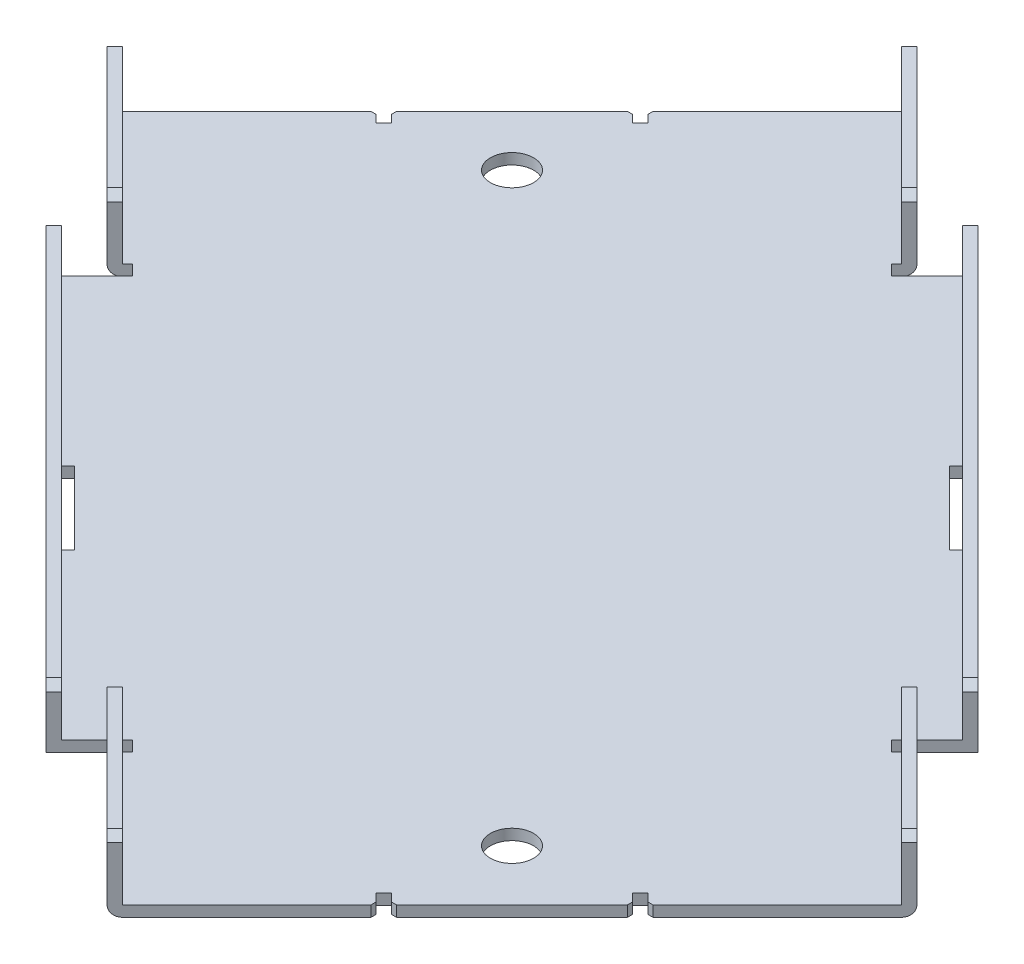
ISO-10303-21;
HEADER;
FILE_DESCRIPTION(('STEP AP214'),'2;1');
FILE_NAME('part.step','',(''),(''),'','','');
FILE_SCHEMA(('AUTOMOTIVE_DESIGN { 1 0 10303 214 1 1 1 1 }'));
ENDSEC;
DATA;
#1=APPLICATION_CONTEXT('core data for automotive mechanical design processes');
#2=APPLICATION_PROTOCOL_DEFINITION('international standard','automotive_design',2000,#1);
#3=PRODUCT_CONTEXT('',#1,'mechanical');
#4=PRODUCT('Part','Part','',(#3));
#5=PRODUCT_RELATED_PRODUCT_CATEGORY('part','',(#4));
#6=PRODUCT_DEFINITION_FORMATION('','',#4);
#7=PRODUCT_DEFINITION_CONTEXT('part definition',#1,'design');
#8=PRODUCT_DEFINITION('design','',#6,#7);
#9=PRODUCT_DEFINITION_SHAPE('','',#8);
#10=(LENGTH_UNIT() NAMED_UNIT(*) SI_UNIT(.MILLI.,.METRE.));
#11=(NAMED_UNIT(*) PLANE_ANGLE_UNIT() SI_UNIT($,.RADIAN.));
#12=(NAMED_UNIT(*) SI_UNIT($,.STERADIAN.) SOLID_ANGLE_UNIT());
#13=UNCERTAINTY_MEASURE_WITH_UNIT(LENGTH_MEASURE(1.E-05),#10,'distance_accuracy_value','');
#14=(GEOMETRIC_REPRESENTATION_CONTEXT(3) GLOBAL_UNCERTAINTY_ASSIGNED_CONTEXT((#13)) GLOBAL_UNIT_ASSIGNED_CONTEXT((#10,
#11,#12)) REPRESENTATION_CONTEXT('',''));
#15=CARTESIAN_POINT('',(0.,0.,0.));
#16=DIRECTION('',(0.,0.,1.));
#17=DIRECTION('',(1.,0.,0.));
#18=AXIS2_PLACEMENT_3D('',#15,#16,#17);
#19=CARTESIAN_POINT('',(180.593215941,-59.179187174,-133.842076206));
#20=DIRECTION('',(0.,-1.,0.));
#21=DIRECTION('',(0.,0.,-1.));
#22=AXIS2_PLACEMENT_3D('',#19,#20,#21);
#23=PLANE('',#22);
#24=DIRECTION('',(-0.707106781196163,0.,-0.707106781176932));
#25=VECTOR('',#24,1.);
#26=CARTESIAN_POINT('',(199.901473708,-59.179187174,-153.1503339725));
#27=LINE('',#26,#25);
#28=CARTESIAN_POINT('',(216.872036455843,-59.1791871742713,-136.179771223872));
#29=VERTEX_POINT('',#28);
#30=CARTESIAN_POINT('',(182.930910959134,-59.17918717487,-170.120896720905));
#31=VERTEX_POINT('',#30);
#32=EDGE_CURVE('E535',#29,#31,#27,.T.);
#33=ORIENTED_EDGE('',*,*,#32,.T.);
#34=DIRECTION('',(0.707106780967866,-3.93960327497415E-10,-0.707106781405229));
#35=VECTOR('',#34,1.);
#36=CARTESIAN_POINT('',(180.809590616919,-59.1791871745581,-167.999576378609));
#37=LINE('',#36,#35);
#38=CARTESIAN_POINT('',(180.809590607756,-59.1791871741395,-167.999576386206));
#39=VERTEX_POINT('',#38);
#40=EDGE_CURVE('E22',#39,#31,#37,.T.);
#41=ORIENTED_EDGE('',*,*,#40,.F.);
#42=DIRECTION('',(-0.707106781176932,0.,-0.707106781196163));
#43=VECTOR('',#42,1.);
#44=CARTESIAN_POINT('',(197.7801533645,-59.179187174,-151.029013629));
#45=LINE('',#44,#43);
#46=CARTESIAN_POINT('',(214.750716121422,-59.1791871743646,-134.058450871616));
#47=VERTEX_POINT('',#46);
#48=EDGE_CURVE('E521',#47,#39,#45,.T.);
#49=ORIENTED_EDGE('',*,*,#48,.F.);
#50=DIRECTION('',(-0.707106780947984,-3.65614945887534E-10,0.707106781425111));
#51=VECTOR('',#50,1.);
#52=CARTESIAN_POINT('',(216.87203645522,-59.1791871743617,-136.179771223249));
#53=LINE('',#52,#51);
#54=EDGE_CURVE('E613',#29,#47,#53,.T.);
#55=ORIENTED_EDGE('',*,*,#54,.F.);
#56=EDGE_LOOP('',(#33,#41,#49,#55));
#57=FACE_BOUND('',#56,.T.);
#58=ADVANCED_FACE('F18',(#57),#23,.F.);
#59=CARTESIAN_POINT('',(179.37416385,-62.203187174,-170.840731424));
#60=DIRECTION('',(-0.49999999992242,0.707106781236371,-0.500000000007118));
#61=DIRECTION('',(0.,0.577350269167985,0.816496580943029));
#62=AXIS2_PLACEMENT_3D('',#59,#60,#61);
#63=PLANE('',#62);
#64=DIRECTION('',(-0.500000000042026,-0.707106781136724,-0.500000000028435));
#65=VECTOR('',#64,1.);
#66=CARTESIAN_POINT('',(182.930910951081,-59.1791871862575,-170.120896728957));
#67=LINE('',#66,#65);
#68=CARTESIAN_POINT('',(181.516697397,-61.1791871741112,-171.535110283));
#69=VERTEX_POINT('',#68);
#70=EDGE_CURVE('E617',#31,#69,#67,.T.);
#71=ORIENTED_EDGE('',*,*,#70,.T.);
#72=DIRECTION('',(0.707106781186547,0.,-0.707106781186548));
#73=VECTOR('',#72,1.);
#74=CARTESIAN_POINT('',(163.1717738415,-61.179187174,-153.1901867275));
#75=LINE('',#74,#73);
#76=CARTESIAN_POINT('',(179.395377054,-61.1791871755,-169.41378994));
#77=VERTEX_POINT('',#76);
#78=EDGE_CURVE('E540',#77,#69,#75,.T.);
#79=ORIENTED_EDGE('',*,*,#78,.F.);
#80=DIRECTION('',(-0.499999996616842,-0.707106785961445,-0.499999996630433));
#81=VECTOR('',#80,1.);
#82=CARTESIAN_POINT('',(180.809590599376,-59.179187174,-167.999576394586));
#83=LINE('',#82,#81);
#84=EDGE_CURVE('E525',#39,#77,#83,.T.);
#85=ORIENTED_EDGE('',*,*,#84,.F.);
#86=ORIENTED_EDGE('',*,*,#40,.T.);
#87=EDGE_LOOP('',(#71,#79,#85,#86));
#88=FACE_BOUND('',#87,.T.);
#89=ADVANCED_FACE('F538',(#88),#63,.T.);
#90=CARTESIAN_POINT('',(181.516697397,-76.179187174,-171.535110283));
#91=DIRECTION('',(-0.707106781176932,0.,0.707106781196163));
#92=DIRECTION('',(0.707106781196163,0.,0.707106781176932));
#93=AXIS2_PLACEMENT_3D('',#90,#91,#92);
#94=PLANE('',#93);
#95=DIRECTION('',(0.,1.,0.));
#96=VECTOR('',#95,1.);
#97=CARTESIAN_POINT('',(218.286250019,-70.179187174,-134.765557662));
#98=LINE('',#97,#96);
#99=CARTESIAN_POINT('',(218.286250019,-76.1791871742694,-134.765557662));
#100=VERTEX_POINT('',#99);
#101=CARTESIAN_POINT('',(218.286250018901,-61.17918717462,-134.765557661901));
#102=VERTEX_POINT('',#101);
#103=EDGE_CURVE('E544',#100,#102,#98,.T.);
#104=ORIENTED_EDGE('',*,*,#103,.F.);
#105=DIRECTION('',(0.707106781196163,0.,0.707106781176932));
#106=VECTOR('',#105,1.);
#107=CARTESIAN_POINT('',(199.901473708,-76.1791871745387,-153.1503339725));
#108=LINE('',#107,#106);
#109=CARTESIAN_POINT('',(181.516697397,-76.1791871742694,-171.535110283));
#110=VERTEX_POINT('',#109);
#111=EDGE_CURVE('E567',#100,#110,#108,.F.);
#112=ORIENTED_EDGE('',*,*,#111,.T.);
#113=DIRECTION('',(0.,-1.,0.));
#114=VECTOR('',#113,1.);
#115=CARTESIAN_POINT('',(181.516697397,-70.179187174,-171.535110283));
#116=LINE('',#115,#114);
#117=EDGE_CURVE('E553',#69,#110,#116,.T.);
#118=ORIENTED_EDGE('',*,*,#117,.F.);
#119=ORIENTED_EDGE('',*,*,#70,.F.);
#120=ORIENTED_EDGE('',*,*,#32,.F.);
#121=DIRECTION('',(-0.500000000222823,0.707106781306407,-0.499999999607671));
#122=VECTOR('',#121,1.);
#123=CARTESIAN_POINT('',(218.286250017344,-61.179187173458,-134.765557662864));
#124=LINE('',#123,#122);
#125=EDGE_CURVE('E615',#102,#29,#124,.T.);
#126=ORIENTED_EDGE('',*,*,#125,.F.);
#127=EDGE_LOOP('',(#104,#112,#118,#119,#120,#126));
#128=FACE_BOUND('',#127,.T.);
#129=ADVANCED_FACE('F1459',(#128),#94,.F.);
#130=CARTESIAN_POINT('',(214.729502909,-58.155187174,-135.485392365));
#131=DIRECTION('',(0.500000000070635,0.707106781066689,0.50000000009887));
#132=DIRECTION('',(0.,-0.577350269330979,0.816496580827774));
#133=AXIS2_PLACEMENT_3D('',#130,#131,#132);
#134=PLANE('',#133);
#135=ORIENTED_EDGE('',*,*,#125,.T.);
#136=ORIENTED_EDGE('',*,*,#54,.T.);
#137=DIRECTION('',(-0.499999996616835,0.707106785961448,-0.499999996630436));
#138=VECTOR('',#137,1.);
#139=CARTESIAN_POINT('',(216.164929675,-61.179187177,-132.644237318));
#140=LINE('',#139,#138);
#141=CARTESIAN_POINT('',(216.1649296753,-61.1791871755,-132.6442373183));
#142=VERTEX_POINT('',#141);
#143=EDGE_CURVE('E529',#142,#47,#140,.T.);
#144=ORIENTED_EDGE('',*,*,#143,.F.);
#145=DIRECTION('',(-0.70710678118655,0.,0.707106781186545));
#146=VECTOR('',#145,1.);
#147=CARTESIAN_POINT('',(216.518483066,-61.179187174,-132.997790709));
#148=LINE('',#147,#146);
#149=EDGE_CURVE('E627',#102,#142,#148,.T.);
#150=ORIENTED_EDGE('',*,*,#149,.F.);
#151=EDGE_LOOP('',(#135,#136,#144,#150));
#152=FACE_BOUND('',#151,.T.);
#153=ADVANCED_FACE('F1462',(#152),#134,.T.);
#154=CARTESIAN_POINT('',(273.130159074,-73.529187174,-94.770891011));
#155=DIRECTION('',(0.,-1.,0.));
#156=DIRECTION('',(1.,0.,0.));
#157=AXIS2_PLACEMENT_3D('',#154,#155,#156);
#158=PLANE('',#157);
#159=DIRECTION('',(-0.707106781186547,0.,-0.707106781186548));
#160=VECTOR('',#159,1.);
#161=CARTESIAN_POINT('',(285.4613942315,-73.529187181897,-84.5609761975));
#162=LINE('',#161,#160);
#163=CARTESIAN_POINT('',(295.537665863,-73.5291871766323,-74.484704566));
#164=VERTEX_POINT('',#163);
#165=CARTESIAN_POINT('',(275.385122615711,-73.5291871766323,-94.6372478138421));
#166=VERTEX_POINT('',#165);
#167=EDGE_CURVE('E563',#164,#166,#162,.T.);
#168=ORIENTED_EDGE('',*,*,#167,.F.);
#169=DIRECTION('',(0.707106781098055,0.,-0.70710678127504));
#170=VECTOR('',#169,1.);
#171=CARTESIAN_POINT('',(293.5400892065,-73.529187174,-72.487127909));
#172=LINE('',#171,#170);
#173=CARTESIAN_POINT('',(293.416345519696,-73.529187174,-72.3633842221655));
#174=VERTEX_POINT('',#173);
#175=EDGE_CURVE('E1095',#174,#164,#172,.T.);
#176=ORIENTED_EDGE('',*,*,#175,.F.);
#177=DIRECTION('',(-0.707106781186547,0.,-0.707106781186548));
#178=VECTOR('',#177,1.);
#179=CARTESIAN_POINT('',(283.340073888,-73.5291871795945,-82.439655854));
#180=LINE('',#179,#178);
#181=CARTESIAN_POINT('',(273.263802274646,-73.5291871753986,-92.5159274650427));
#182=VERTEX_POINT('',#181);
#183=EDGE_CURVE('E726',#174,#182,#180,.T.);
#184=ORIENTED_EDGE('',*,*,#183,.T.);
#185=DIRECTION('',(-0.707106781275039,0.,0.707106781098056));
#186=VECTOR('',#185,1.);
#187=CARTESIAN_POINT('',(273.387545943,-73.529187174,-92.6396711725));
#188=LINE('',#187,#186);
#189=EDGE_CURVE('E1112',#166,#182,#188,.T.);
#190=ORIENTED_EDGE('',*,*,#189,.F.);
#191=EDGE_LOOP('',(#168,#176,#184,#190));
#192=FACE_BOUND('',#191,.T.);
#193=ADVANCED_FACE('F1466',(#192),#158,.T.);
#194=CARTESIAN_POINT('',(227.457424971,-65.615907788,-139.728033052));
#195=DIRECTION('',(-0.499999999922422,0.70710678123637,-0.500000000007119));
#196=DIRECTION('',(0.,0.577350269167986,0.816496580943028));
#197=AXIS2_PLACEMENT_3D('',#194,#195,#196);
#198=PLANE('',#197);
#199=DIRECTION('',(0.50000000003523,0.707106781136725,0.50000000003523));
#200=VECTOR('',#199,1.);
#201=CARTESIAN_POINT('',(227.478638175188,-64.5919077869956,-138.301091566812));
#202=LINE('',#201,#200);
#203=CARTESIAN_POINT('',(227.478638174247,-64.5919077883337,-138.301091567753));
#204=VERTEX_POINT('',#203);
#205=CARTESIAN_POINT('',(228.89285174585,-62.591907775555,-136.88687799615));
#206=VERTEX_POINT('',#205);
#207=EDGE_CURVE('E1031',#204,#206,#202,.T.);
#208=ORIENTED_EDGE('',*,*,#207,.T.);
#209=DIRECTION('',(0.7071067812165,-4.23411302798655E-11,-0.707106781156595));
#210=VECTOR('',#209,1.);
#211=CARTESIAN_POINT('',(228.892851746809,-62.5919077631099,-136.88687797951));
#212=LINE('',#211,#210);
#213=CARTESIAN_POINT('',(231.014172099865,-62.5919077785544,-139.008198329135));
#214=VERTEX_POINT('',#213);
#215=EDGE_CURVE('E610',#206,#214,#212,.T.);
#216=ORIENTED_EDGE('',*,*,#215,.T.);
#217=DIRECTION('',(0.50000000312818,0.707106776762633,0.50000000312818));
#218=VECTOR('',#217,1.);
#219=CARTESIAN_POINT('',(229.599958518,-64.5919077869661,-140.422411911));
#220=LINE('',#219,#218);
#221=CARTESIAN_POINT('',(229.599958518,-64.5919077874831,-140.422411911));
#222=VERTEX_POINT('',#221);
#223=EDGE_CURVE('E565',#222,#214,#220,.T.);
#224=ORIENTED_EDGE('',*,*,#223,.F.);
#225=DIRECTION('',(0.707106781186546,0.,-0.707106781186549));
#226=VECTOR('',#225,1.);
#227=CARTESIAN_POINT('',(223.589550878,-64.591907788,-134.412004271));
#228=LINE('',#227,#226);
#229=EDGE_CURVE('E1041',#204,#222,#228,.T.);
#230=ORIENTED_EDGE('',*,*,#229,.F.);
#231=EDGE_LOOP('',(#208,#216,#224,#230));
#232=FACE_BOUND('',#231,.T.);
#233=ADVANCED_FACE('F1234',(#232),#198,.T.);
#234=CARTESIAN_POINT('',(228.226757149,-62.591907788,-27.326339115));
#235=DIRECTION('',(0.,-1.,0.));
#236=DIRECTION('',(0.,0.,-1.));
#237=AXIS2_PLACEMENT_3D('',#234,#235,#236);
#238=PLANE('',#237);
#239=DIRECTION('',(0.707106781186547,0.,0.707106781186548));
#240=VECTOR('',#239,1.);
#241=CARTESIAN_POINT('',(285.4613942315,-62.591907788,-84.5609761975));
#242=LINE('',#241,#240);
#243=CARTESIAN_POINT('',(339.908616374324,-62.5919077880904,-30.1137540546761));
#244=VERTEX_POINT('',#243);
#245=EDGE_CURVE('E564',#214,#244,#242,.T.);
#246=ORIENTED_EDGE('',*,*,#245,.F.);
#247=ORIENTED_EDGE('',*,*,#215,.F.);
#248=DIRECTION('',(0.707106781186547,0.,0.707106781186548));
#249=VECTOR('',#248,1.);
#250=CARTESIAN_POINT('',(283.340073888,-62.591907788,-82.439655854));
#251=LINE('',#250,#249);
#252=CARTESIAN_POINT('',(337.787296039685,-62.5919077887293,-27.9924337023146));
#253=VERTEX_POINT('',#252);
#254=EDGE_CURVE('E620',#206,#253,#251,.T.);
#255=ORIENTED_EDGE('',*,*,#254,.T.);
#256=DIRECTION('',(-0.707106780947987,-3.65619571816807E-10,0.707106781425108));
#257=VECTOR('',#256,1.);
#258=CARTESIAN_POINT('',(339.90861638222,-62.5919077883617,-30.1137540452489));
#259=LINE('',#258,#257);
#260=EDGE_CURVE('E608',#244,#253,#259,.T.);
#261=ORIENTED_EDGE('',*,*,#260,.F.);
#262=EDGE_LOOP('',(#246,#247,#255,#261));
#263=FACE_BOUND('',#262,.T.);
#264=ADVANCED_FACE('F1231',(#263),#238,.F.);
#265=CARTESIAN_POINT('',(337.766082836,-61.567907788,-29.419375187));
#266=DIRECTION('',(0.500000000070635,0.707106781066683,0.500000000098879));
#267=DIRECTION('',(0.,-0.577350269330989,0.816496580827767));
#268=AXIS2_PLACEMENT_3D('',#265,#266,#267);
#269=PLANE('',#268);
#270=DIRECTION('',(0.500000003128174,-0.70710677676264,0.500000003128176));
#271=VECTOR('',#270,1.);
#272=CARTESIAN_POINT('',(339.908616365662,-62.591907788,-30.1137540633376));
#273=LINE('',#272,#271);
#274=CARTESIAN_POINT('',(341.322829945,-64.5919077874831,-28.699540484));
#275=VERTEX_POINT('',#274);
#276=EDGE_CURVE('E561',#244,#275,#273,.T.);
#277=ORIENTED_EDGE('',*,*,#276,.F.);
#278=ORIENTED_EDGE('',*,*,#260,.T.);
#279=DIRECTION('',(0.499999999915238,-0.707106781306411,0.49999999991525));
#280=VECTOR('',#279,1.);
#281=CARTESIAN_POINT('',(337.78729603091,-62.5919077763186,-27.9924337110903));
#282=LINE('',#281,#280);
#283=CARTESIAN_POINT('',(339.201509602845,-64.5919077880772,-26.5782201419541));
#284=VERTEX_POINT('',#283);
#285=EDGE_CURVE('E1028',#253,#284,#282,.T.);
#286=ORIENTED_EDGE('',*,*,#285,.T.);
#287=DIRECTION('',(-0.707106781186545,0.,0.70710678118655));
#288=VECTOR('',#287,1.);
#289=CARTESIAN_POINT('',(335.312422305,-64.591907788,-22.689132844));
#290=LINE('',#289,#288);
#291=EDGE_CURVE('E631',#275,#284,#290,.T.);
#292=ORIENTED_EDGE('',*,*,#291,.F.);
#293=EDGE_LOOP('',(#277,#278,#286,#292));
#294=FACE_BOUND('',#293,.T.);
#295=ADVANCED_FACE('F1475',(#294),#269,.T.);
#296=CARTESIAN_POINT('',(334.742069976,-59.179187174,20.378337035));
#297=DIRECTION('',(0.,-1.,0.));
#298=DIRECTION('',(0.,0.,-1.));
#299=AXIS2_PLACEMENT_3D('',#296,#297,#298);
#300=PLANE('',#299);
#301=DIRECTION('',(-0.707106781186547,0.,-0.707106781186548));
#302=VECTOR('',#301,1.);
#303=CARTESIAN_POINT('',(354.086107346,-59.179187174,1.034299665));
#304=LINE('',#303,#302);
#305=CARTESIAN_POINT('',(371.092025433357,-59.1791871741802,18.040217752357));
#306=VERTEX_POINT('',#305);
#307=CARTESIAN_POINT('',(337.080189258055,-59.179187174,-15.9716184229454));
#308=VERTEX_POINT('',#307);
#309=EDGE_CURVE('E602',#306,#308,#304,.T.);
#310=ORIENTED_EDGE('',*,*,#309,.T.);
#311=DIRECTION('',(-0.707106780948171,0.,0.707106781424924));
#312=VECTOR('',#311,1.);
#313=CARTESIAN_POINT('',(337.080189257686,-59.179187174,-15.9716184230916));
#314=LINE('',#313,#312);
#315=CARTESIAN_POINT('',(334.958868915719,-59.179187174,-13.8502980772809));
#316=VERTEX_POINT('',#315);
#317=EDGE_CURVE('E605',#308,#316,#314,.T.);
#318=ORIENTED_EDGE('',*,*,#317,.T.);
#319=DIRECTION('',(-0.707106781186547,0.,-0.707106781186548));
#320=VECTOR('',#319,1.);
#321=CARTESIAN_POINT('',(351.964787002,-59.179187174,3.155620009));
#322=LINE('',#321,#320);
#323=CARTESIAN_POINT('',(368.970705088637,-59.1791871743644,20.1615380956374));
#324=VERTEX_POINT('',#323);
#325=EDGE_CURVE('E1020',#324,#316,#322,.T.);
#326=ORIENTED_EDGE('',*,*,#325,.F.);
#327=DIRECTION('',(-0.707106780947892,-3.65739845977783E-10,0.707106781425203));
#328=VECTOR('',#327,1.);
#329=CARTESIAN_POINT('',(371.09202543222,-59.1791871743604,18.0402177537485));
#330=LINE('',#329,#328);
#331=EDGE_CURVE('E603',#306,#324,#330,.T.);
#332=ORIENTED_EDGE('',*,*,#331,.F.);
#333=EDGE_LOOP('',(#310,#318,#326,#332));
#334=FACE_BOUND('',#333,.T.);
#335=ADVANCED_FACE('F1068',(#334),#300,.F.);
#336=CARTESIAN_POINT('',(333.523442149,-59.841853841,-13.3520235));
#337=DIRECTION('',(0.500000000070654,-0.707106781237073,0.499999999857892));
#338=DIRECTION('',(0.,-0.577350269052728,-0.816496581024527));
#339=AXIS2_PLACEMENT_3D('',#336,#337,#338);
#340=PLANE('',#339);
#341=DIRECTION('',(-0.500000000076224,-0.707106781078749,-0.500000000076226));
#342=VECTOR('',#341,1.);
#343=CARTESIAN_POINT('',(334.958868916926,-59.179187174,-13.8502980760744));
#344=LINE('',#343,#342);
#345=CARTESIAN_POINT('',(333.544655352,-61.1791871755,-15.264511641));
#346=VERTEX_POINT('',#345);
#347=EDGE_CURVE('E1016',#316,#346,#344,.T.);
#348=ORIENTED_EDGE('',*,*,#347,.F.);
#349=ORIENTED_EDGE('',*,*,#317,.F.);
#350=DIRECTION('',(-0.50000000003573,-0.707106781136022,-0.500000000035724));
#351=VECTOR('',#350,1.);
#352=CARTESIAN_POINT('',(337.080189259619,-59.1791871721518,-15.9716184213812));
#353=LINE('',#352,#351);
#354=CARTESIAN_POINT('',(335.665975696,-61.1791871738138,-17.385831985));
#355=VERTEX_POINT('',#354);
#356=EDGE_CURVE('E600',#308,#355,#353,.T.);
#357=ORIENTED_EDGE('',*,*,#356,.T.);
#358=DIRECTION('',(-0.707106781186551,0.,0.707106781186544));
#359=VECTOR('',#358,1.);
#360=CARTESIAN_POINT('',(333.898208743,-61.179187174,-15.618065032));
#361=LINE('',#360,#359);
#362=EDGE_CURVE('E635',#355,#346,#361,.T.);
#363=ORIENTED_EDGE('',*,*,#362,.T.);
#364=EDGE_LOOP('',(#348,#349,#357,#363));
#365=FACE_BOUND('',#364,.T.);
#366=ADVANCED_FACE('F1080',(#365),#340,.F.);
#367=CARTESIAN_POINT('',(368.949491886,-58.155187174,18.734596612));
#368=DIRECTION('',(0.500000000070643,0.707106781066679,0.500000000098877));
#369=DIRECTION('',(0.,-0.577350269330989,0.816496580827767));
#370=AXIS2_PLACEMENT_3D('',#367,#368,#369);
#371=PLANE('',#370);
#372=DIRECTION('',(-0.499999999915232,0.707106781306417,-0.499999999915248));
#373=VECTOR('',#372,1.);
#374=CARTESIAN_POINT('',(372.506238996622,-61.17918717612,19.4544313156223));
#375=LINE('',#374,#373);
#376=CARTESIAN_POINT('',(372.506238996,-61.17918717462,19.454431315));
#377=VERTEX_POINT('',#376);
#378=EDGE_CURVE('E596',#377,#306,#375,.T.);
#379=ORIENTED_EDGE('',*,*,#378,.T.);
#380=ORIENTED_EDGE('',*,*,#331,.T.);
#381=DIRECTION('',(-0.500000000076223,0.707106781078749,-0.500000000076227));
#382=VECTOR('',#381,1.);
#383=CARTESIAN_POINT('',(370.384918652,-61.179187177,21.575751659));
#384=LINE('',#383,#382);
#385=CARTESIAN_POINT('',(370.384918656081,-61.1791871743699,21.5757516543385));
#386=VERTEX_POINT('',#385);
#387=EDGE_CURVE('E634',#386,#324,#384,.T.);
#388=ORIENTED_EDGE('',*,*,#387,.F.);
#389=DIRECTION('',(-0.707106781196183,0.,0.707106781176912));
#390=VECTOR('',#389,1.);
#391=CARTESIAN_POINT('',(354.16131544,-61.179187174,37.7993548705));
#392=LINE('',#391,#390);
#393=EDGE_CURVE('E1019',#377,#386,#392,.T.);
#394=ORIENTED_EDGE('',*,*,#393,.F.);
#395=EDGE_LOOP('',(#379,#380,#388,#394));
#396=FACE_BOUND('',#395,.T.);
#397=ADVANCED_FACE('F1483',(#396),#371,.T.);
#398=CARTESIAN_POINT('',(335.665975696,-76.179187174,-17.385831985));
#399=DIRECTION('',(-0.707106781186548,0.,0.707106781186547));
#400=DIRECTION('',(0.707106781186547,0.,0.707106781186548));
#401=AXIS2_PLACEMENT_3D('',#398,#399,#400);
#402=PLANE('',#401);
#403=DIRECTION('',(0.,1.,0.));
#404=VECTOR('',#403,1.);
#405=CARTESIAN_POINT('',(372.506238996,-70.179187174,19.454431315));
#406=LINE('',#405,#404);
#407=CARTESIAN_POINT('',(372.506238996,-76.1791871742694,19.454431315));
#408=VERTEX_POINT('',#407);
#409=EDGE_CURVE('E1014',#408,#377,#406,.T.);
#410=ORIENTED_EDGE('',*,*,#409,.F.);
#411=DIRECTION('',(0.707106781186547,0.,0.707106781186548));
#412=VECTOR('',#411,1.);
#413=CARTESIAN_POINT('',(354.086107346,-76.1791871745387,1.034299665));
#414=LINE('',#413,#412);
#415=CARTESIAN_POINT('',(335.665975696,-76.1791871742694,-17.385831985));
#416=VERTEX_POINT('',#415);
#417=EDGE_CURVE('E1092',#408,#416,#414,.F.);
#418=ORIENTED_EDGE('',*,*,#417,.T.);
#419=DIRECTION('',(0.,1.,0.));
#420=VECTOR('',#419,1.);
#421=CARTESIAN_POINT('',(335.665975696,-70.179187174,-17.385831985));
#422=LINE('',#421,#420);
#423=EDGE_CURVE('E1026',#416,#355,#422,.T.);
#424=ORIENTED_EDGE('',*,*,#423,.T.);
#425=ORIENTED_EDGE('',*,*,#356,.F.);
#426=ORIENTED_EDGE('',*,*,#309,.F.);
#427=ORIENTED_EDGE('',*,*,#378,.F.);
#428=EDGE_LOOP('',(#410,#418,#424,#425,#426,#427));
#429=FACE_BOUND('',#428,.T.);
#430=ADVANCED_FACE('F1074',(#429),#402,.F.);
#431=CARTESIAN_POINT('',(335.816391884,-79.179187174,56.144278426));
#432=DIRECTION('',(0.,0.,-1.));
#433=DIRECTION('',(-1.,0.,0.));
#434=AXIS2_PLACEMENT_3D('',#431,#432,#433);
#435=PLANE('',#434);
#436=DIRECTION('',(-1.,0.,0.));
#437=VECTOR('',#436,1.);
#438=CARTESIAN_POINT('',(335.109285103,-79.179187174,56.144278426));
#439=LINE('',#438,#437);
#440=CARTESIAN_POINT('',(335.816391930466,-79.179187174,56.144278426));
#441=VERTEX_POINT('',#440);
#442=CARTESIAN_POINT('',(334.402178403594,-79.179187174,56.144278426));
#443=VERTEX_POINT('',#442);
#444=EDGE_CURVE('E684',#441,#443,#439,.T.);
#445=ORIENTED_EDGE('',*,*,#444,.F.);
#446=DIRECTION('',(0.,-1.,0.));
#447=VECTOR('',#446,1.);
#448=CARTESIAN_POINT('',(335.816391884,-70.179187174,56.144278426));
#449=LINE('',#448,#447);
#450=CARTESIAN_POINT('',(335.816391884,-76.179187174,56.144278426));
#451=VERTEX_POINT('',#450);
#452=EDGE_CURVE('E1015',#451,#441,#449,.T.);
#453=ORIENTED_EDGE('',*,*,#452,.F.);
#454=DIRECTION('',(1.,0.,0.));
#455=VECTOR('',#454,1.);
#456=CARTESIAN_POINT('',(335.109285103,-76.179187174,56.144278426));
#457=LINE('',#456,#455);
#458=CARTESIAN_POINT('',(334.402178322,-76.179187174,56.144278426));
#459=VERTEX_POINT('',#458);
#460=EDGE_CURVE('E599',#459,#451,#457,.T.);
#461=ORIENTED_EDGE('',*,*,#460,.F.);
#462=DIRECTION('',(0.,1.,0.));
#463=VECTOR('',#462,1.);
#464=CARTESIAN_POINT('',(334.402178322,-77.679187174,56.144278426));
#465=LINE('',#464,#463);
#466=EDGE_CURVE('E678',#443,#459,#465,.T.);
#467=ORIENTED_EDGE('',*,*,#466,.F.);
#468=EDGE_LOOP('',(#445,#453,#461,#467));
#469=FACE_BOUND('',#468,.T.);
#470=ADVANCED_FACE('F1410',(#469),#435,.F.);
#471=CARTESIAN_POINT('',(332.280857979,-79.179187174,58.26559877));
#472=DIRECTION('',(-1.,0.,0.));
#473=DIRECTION('',(0.,0.,1.));
#474=AXIS2_PLACEMENT_3D('',#471,#472,#473);
#475=PLANE('',#474);
#476=DIRECTION('',(0.,0.,-1.));
#477=VECTOR('',#476,1.);
#478=CARTESIAN_POINT('',(332.280857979,-76.179187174,58.972705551));
#479=LINE('',#478,#477);
#480=CARTESIAN_POINT('',(332.280857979,-76.179187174,59.679812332));
#481=VERTEX_POINT('',#480);
#482=CARTESIAN_POINT('',(332.280857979,-76.179187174,58.26559877));
#483=VERTEX_POINT('',#482);
#484=EDGE_CURVE('E683',#481,#483,#479,.T.);
#485=ORIENTED_EDGE('',*,*,#484,.F.);
#486=DIRECTION('',(0.,1.,0.));
#487=VECTOR('',#486,1.);
#488=CARTESIAN_POINT('',(332.280857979,-77.679187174,59.679812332));
#489=LINE('',#488,#487);
#490=CARTESIAN_POINT('',(332.280857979,-79.179187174,59.6798123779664));
#491=VERTEX_POINT('',#490);
#492=EDGE_CURVE('E688',#491,#481,#489,.T.);
#493=ORIENTED_EDGE('',*,*,#492,.F.);
#494=DIRECTION('',(0.,0.,1.));
#495=VECTOR('',#494,1.);
#496=CARTESIAN_POINT('',(332.280857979,-79.179187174,58.972705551));
#497=LINE('',#496,#495);
#498=CARTESIAN_POINT('',(332.280857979,-79.179187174,58.2655988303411));
#499=VERTEX_POINT('',#498);
#500=EDGE_CURVE('E681',#499,#491,#497,.T.);
#501=ORIENTED_EDGE('',*,*,#500,.F.);
#502=DIRECTION('',(0.,-1.,0.));
#503=VECTOR('',#502,1.);
#504=CARTESIAN_POINT('',(332.280857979,-77.679187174,58.26559877));
#505=LINE('',#504,#503);
#506=EDGE_CURVE('E680',#483,#499,#505,.T.);
#507=ORIENTED_EDGE('',*,*,#506,.F.);
#508=EDGE_LOOP('',(#485,#493,#501,#507));
#509=FACE_BOUND('',#508,.T.);
#510=ADVANCED_FACE('F1392',(#509),#475,.F.);
#511=CARTESIAN_POINT('',(298.76399655,-79.179187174,91.782460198));
#512=DIRECTION('',(0.,0.,1.));
#513=DIRECTION('',(1.,0.,0.));
#514=AXIS2_PLACEMENT_3D('',#511,#512,#513);
#515=PLANE('',#514);
#516=DIRECTION('',(1.,0.,0.));
#517=VECTOR('',#516,1.);
#518=CARTESIAN_POINT('',(299.4711033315,-79.179187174,91.782460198));
#519=LINE('',#518,#517);
#520=CARTESIAN_POINT('',(298.763996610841,-79.179187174,91.782460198));
#521=VERTEX_POINT('',#520);
#522=CARTESIAN_POINT('',(300.178210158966,-79.179187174,91.782460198));
#523=VERTEX_POINT('',#522);
#524=EDGE_CURVE('E692',#521,#523,#519,.T.);
#525=ORIENTED_EDGE('',*,*,#524,.T.);
#526=DIRECTION('',(0.,-1.,0.));
#527=VECTOR('',#526,1.);
#528=CARTESIAN_POINT('',(300.178210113,-77.679187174,91.782460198));
#529=LINE('',#528,#527);
#530=CARTESIAN_POINT('',(300.178210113,-76.179187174,91.782460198));
#531=VERTEX_POINT('',#530);
#532=EDGE_CURVE('E687',#531,#523,#529,.T.);
#533=ORIENTED_EDGE('',*,*,#532,.F.);
#534=DIRECTION('',(-1.,0.,0.));
#535=VECTOR('',#534,1.);
#536=CARTESIAN_POINT('',(299.4711033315,-76.179187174,91.782460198));
#537=LINE('',#536,#535);
#538=CARTESIAN_POINT('',(298.76399655,-76.179187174,91.782460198));
#539=VERTEX_POINT('',#538);
#540=EDGE_CURVE('E695',#531,#539,#537,.T.);
#541=ORIENTED_EDGE('',*,*,#540,.T.);
#542=DIRECTION('',(0.,-1.,0.));
#543=VECTOR('',#542,1.);
#544=CARTESIAN_POINT('',(298.76399655,-77.679187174,91.782460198));
#545=LINE('',#544,#543);
#546=EDGE_CURVE('E691',#539,#521,#545,.T.);
#547=ORIENTED_EDGE('',*,*,#546,.T.);
#548=EDGE_LOOP('',(#525,#533,#541,#547));
#549=FACE_BOUND('',#548,.T.);
#550=ADVANCED_FACE('F1386',(#549),#515,.T.);
#551=CARTESIAN_POINT('',(296.642676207,-79.179187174,95.317994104));
#552=DIRECTION('',(1.,0.,0.));
#553=DIRECTION('',(0.,0.,-1.));
#554=AXIS2_PLACEMENT_3D('',#551,#552,#553);
#555=PLANE('',#554);
#556=DIRECTION('',(0.,0.,1.));
#557=VECTOR('',#556,1.);
#558=CARTESIAN_POINT('',(296.642676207,-76.179187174,94.610887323));
#559=LINE('',#558,#557);
#560=CARTESIAN_POINT('',(296.642676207,-76.179187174,93.903780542));
#561=VERTEX_POINT('',#560);
#562=CARTESIAN_POINT('',(296.642676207,-76.179187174,95.317994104));
#563=VERTEX_POINT('',#562);
#564=EDGE_CURVE('E595',#561,#563,#559,.T.);
#565=ORIENTED_EDGE('',*,*,#564,.T.);
#566=DIRECTION('',(0.,1.,0.));
#567=VECTOR('',#566,1.);
#568=CARTESIAN_POINT('',(296.642676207,-70.179187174,95.317994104));
#569=LINE('',#568,#567);
#570=CARTESIAN_POINT('',(296.642676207,-79.179187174,95.3179941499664));
#571=VERTEX_POINT('',#570);
#572=EDGE_CURVE('E1009',#571,#563,#569,.T.);
#573=ORIENTED_EDGE('',*,*,#572,.F.);
#574=DIRECTION('',(0.,0.,-1.));
#575=VECTOR('',#574,1.);
#576=CARTESIAN_POINT('',(296.642676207,-79.179187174,94.610887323));
#577=LINE('',#576,#575);
#578=CARTESIAN_POINT('',(296.642676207,-79.179187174,93.903780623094));
#579=VERTEX_POINT('',#578);
#580=EDGE_CURVE('E694',#571,#579,#577,.T.);
#581=ORIENTED_EDGE('',*,*,#580,.T.);
#582=DIRECTION('',(0.,1.,0.));
#583=VECTOR('',#582,1.);
#584=CARTESIAN_POINT('',(296.642676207,-77.679187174,93.903780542));
#585=LINE('',#584,#583);
#586=EDGE_CURVE('E706',#579,#561,#585,.T.);
#587=ORIENTED_EDGE('',*,*,#586,.T.);
#588=EDGE_LOOP('',(#565,#573,#581,#587));
#589=FACE_BOUND('',#588,.T.);
#590=ADVANCED_FACE('F1369',(#589),#555,.T.);
#591=CARTESIAN_POINT('',(224.309980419,-59.179187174,94.243672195));
#592=DIRECTION('',(0.,-1.,0.));
#593=DIRECTION('',(1.,0.,0.));
#594=AXIS2_PLACEMENT_3D('',#591,#592,#593);
#595=PLANE('',#594);
#596=DIRECTION('',(0.707106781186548,0.,0.707106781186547));
#597=VECTOR('',#596,1.);
#598=CARTESIAN_POINT('',(241.532697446,-59.179187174,113.587709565));
#599=LINE('',#598,#597);
#600=CARTESIAN_POINT('',(224.526779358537,-59.1791871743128,96.5817914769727));
#601=VERTEX_POINT('',#600);
#602=CARTESIAN_POINT('',(258.538615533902,-59.1791871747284,130.593627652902));
#603=VERTEX_POINT('',#602);
#604=EDGE_CURVE('E592',#601,#603,#599,.T.);
#605=ORIENTED_EDGE('',*,*,#604,.T.);
#606=DIRECTION('',(-0.707106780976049,-3.65848555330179E-10,0.707106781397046));
#607=VECTOR('',#606,1.);
#608=CARTESIAN_POINT('',(260.659935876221,-59.1791871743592,128.472307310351));
#609=LINE('',#608,#607);
#610=CARTESIAN_POINT('',(260.65993587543,-59.1791871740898,128.47230730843));
#611=VERTEX_POINT('',#610);
#612=EDGE_CURVE('E593',#611,#603,#609,.T.);
#613=ORIENTED_EDGE('',*,*,#612,.F.);
#614=DIRECTION('',(0.707106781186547,0.,0.707106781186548));
#615=VECTOR('',#614,1.);
#616=CARTESIAN_POINT('',(243.654017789,-59.179187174,111.466389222));
#617=LINE('',#616,#615);
#618=CARTESIAN_POINT('',(226.648099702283,-59.1791871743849,94.4604711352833));
#619=VERTEX_POINT('',#618);
#620=EDGE_CURVE('E1004',#619,#611,#617,.T.);
#621=ORIENTED_EDGE('',*,*,#620,.F.);
#622=DIRECTION('',(0.707106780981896,-3.74119716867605E-10,-0.707106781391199));
#623=VECTOR('',#622,1.);
#624=CARTESIAN_POINT('',(224.52677935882,-59.1791871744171,96.5817914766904));
#625=LINE('',#624,#623);
#626=EDGE_CURVE('E585',#601,#619,#625,.T.);
#627=ORIENTED_EDGE('',*,*,#626,.F.);
#628=EDGE_LOOP('',(#605,#613,#621,#627));
#629=FACE_BOUND('',#628,.T.);
#630=ADVANCED_FACE('F1497',(#629),#595,.F.);
#631=CARTESIAN_POINT('',(258.51740233,-58.155187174,129.166686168));
#632=DIRECTION('',(0.499999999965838,0.707106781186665,0.500000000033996));
#633=DIRECTION('',(0.,-0.577350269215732,0.816496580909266));
#634=AXIS2_PLACEMENT_3D('',#631,#632,#633);
#635=PLANE('',#634);
#636=DIRECTION('',(0.500000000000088,-0.70710678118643,0.500000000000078));
#637=VECTOR('',#636,1.);
#638=CARTESIAN_POINT('',(258.538615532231,-59.1791871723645,130.593627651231));
#639=LINE('',#638,#637);
#640=CARTESIAN_POINT('',(259.952829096,-61.1791871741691,132.007841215));
#641=VERTEX_POINT('',#640);
#642=EDGE_CURVE('E590',#603,#641,#639,.T.);
#643=ORIENTED_EDGE('',*,*,#642,.T.);
#644=DIRECTION('',(-0.707106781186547,0.,0.707106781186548));
#645=VECTOR('',#644,1.);
#646=CARTESIAN_POINT('',(278.2977526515,-61.179187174,113.6629176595));
#647=LINE('',#646,#645);
#648=CARTESIAN_POINT('',(262.074149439,-61.1791871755,129.886520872));
#649=VERTEX_POINT('',#648);
#650=EDGE_CURVE('E639',#649,#641,#647,.T.);
#651=ORIENTED_EDGE('',*,*,#650,.F.);
#652=DIRECTION('',(0.500000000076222,-0.707106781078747,0.500000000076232));
#653=VECTOR('',#652,1.);
#654=CARTESIAN_POINT('',(260.659935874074,-59.179187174,128.472307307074));
#655=LINE('',#654,#653);
#656=EDGE_CURVE('E1001',#611,#649,#655,.T.);
#657=ORIENTED_EDGE('',*,*,#656,.F.);
#658=ORIENTED_EDGE('',*,*,#612,.T.);
#659=EDGE_LOOP('',(#643,#651,#657,#658));
#660=FACE_BOUND('',#659,.T.);
#661=ADVANCED_FACE('F1500',(#660),#635,.T.);
#662=CARTESIAN_POINT('',(259.952829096,-76.179187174,132.007841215));
#663=DIRECTION('',(0.707106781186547,0.,-0.707106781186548));
#664=DIRECTION('',(-0.707106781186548,0.,-0.707106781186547));
#665=AXIS2_PLACEMENT_3D('',#662,#663,#664);
#666=PLANE('',#665);
#667=DIRECTION('',(0.,1.,0.));
#668=VECTOR('',#667,1.);
#669=CARTESIAN_POINT('',(223.112565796,-70.179187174,95.167577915));
#670=LINE('',#669,#668);
#671=CARTESIAN_POINT('',(223.112565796,-76.1791871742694,95.167577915));
#672=VERTEX_POINT('',#671);
#673=CARTESIAN_POINT('',(223.112565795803,-61.179187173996,95.1675779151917));
#674=VERTEX_POINT('',#673);
#675=EDGE_CURVE('E1000',#672,#674,#670,.T.);
#676=ORIENTED_EDGE('',*,*,#675,.F.);
#677=DIRECTION('',(-0.707106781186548,0.,-0.707106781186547));
#678=VECTOR('',#677,1.);
#679=CARTESIAN_POINT('',(241.532697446,-76.1791871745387,113.587709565));
#680=LINE('',#679,#678);
#681=CARTESIAN_POINT('',(259.952829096,-76.1791871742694,132.007841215));
#682=VERTEX_POINT('',#681);
#683=EDGE_CURVE('E560',#672,#682,#680,.F.);
#684=ORIENTED_EDGE('',*,*,#683,.T.);
#685=DIRECTION('',(0.,-1.,0.));
#686=VECTOR('',#685,1.);
#687=CARTESIAN_POINT('',(259.952829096,-70.179187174,132.007841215));
#688=LINE('',#687,#686);
#689=EDGE_CURVE('E1010',#641,#682,#688,.T.);
#690=ORIENTED_EDGE('',*,*,#689,.F.);
#691=ORIENTED_EDGE('',*,*,#642,.F.);
#692=ORIENTED_EDGE('',*,*,#604,.F.);
#693=DIRECTION('',(0.500000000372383,0.707106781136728,0.499999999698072));
#694=VECTOR('',#693,1.);
#695=CARTESIAN_POINT('',(223.112565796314,-61.1791871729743,95.1675779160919));
#696=LINE('',#695,#694);
#697=EDGE_CURVE('E587',#674,#601,#696,.T.);
#698=ORIENTED_EDGE('',*,*,#697,.F.);
#699=EDGE_LOOP('',(#676,#684,#690,#691,#692,#698));
#700=FACE_BOUND('',#699,.T.);
#701=ADVANCED_FACE('F1504',(#700),#666,.F.);
#702=CARTESIAN_POINT('',(223.091352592,-62.203187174,93.740636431));
#703=DIRECTION('',(-0.499999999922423,0.707106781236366,-0.500000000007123));
#704=DIRECTION('',(0.,0.577350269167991,0.816496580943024));
#705=AXIS2_PLACEMENT_3D('',#702,#703,#704);
#706=PLANE('',#705);
#707=ORIENTED_EDGE('',*,*,#697,.T.);
#708=ORIENTED_EDGE('',*,*,#626,.T.);
#709=DIRECTION('',(0.50000000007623,0.707106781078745,0.500000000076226));
#710=VECTOR('',#709,1.);
#711=CARTESIAN_POINT('',(225.233886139,-61.179187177,93.046257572));
#712=LINE('',#711,#710);
#713=CARTESIAN_POINT('',(225.23388613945,-61.1791871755,93.04625757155));
#714=VERTEX_POINT('',#713);
#715=EDGE_CURVE('E638',#714,#619,#712,.T.);
#716=ORIENTED_EDGE('',*,*,#715,.F.);
#717=DIRECTION('',(0.707106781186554,0.,-0.707106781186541));
#718=VECTOR('',#717,1.);
#719=CARTESIAN_POINT('',(224.880332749,-61.179187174,93.399810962));
#720=LINE('',#719,#718);
#721=EDGE_CURVE('E643',#674,#714,#720,.T.);
#722=ORIENTED_EDGE('',*,*,#721,.F.);
#723=EDGE_LOOP('',(#707,#708,#716,#722));
#724=FACE_BOUND('',#723,.T.);
#725=ADVANCED_FACE('F1508',(#724),#706,.T.);
#726=CARTESIAN_POINT('',(145.727506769,-73.529187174,32.631761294));
#727=DIRECTION('',(0.,-1.,0.));
#728=DIRECTION('',(1.,0.,0.));
#729=AXIS2_PLACEMENT_3D('',#726,#727,#728);
#730=PLANE('',#729);
#731=DIRECTION('',(0.707106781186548,0.,0.707106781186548));
#732=VECTOR('',#731,1.);
#733=CARTESIAN_POINT('',(158.0587419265,-73.5291871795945,42.8416761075));
#734=LINE('',#733,#732);
#735=CARTESIAN_POINT('',(147.982470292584,-73.529187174,32.7654044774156));
#736=VERTEX_POINT('',#735);
#737=CARTESIAN_POINT('',(168.135013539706,-73.5291871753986,52.9179477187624));
#738=VERTEX_POINT('',#737);
#739=EDGE_CURVE('E721',#736,#738,#734,.T.);
#740=ORIENTED_EDGE('',*,*,#739,.T.);
#741=DIRECTION('',(0.707106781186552,0.,-0.707106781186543));
#742=VECTOR('',#741,1.);
#743=CARTESIAN_POINT('',(168.011269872,-73.529187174,53.041691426));
#744=LINE('',#743,#742);
#745=CARTESIAN_POINT('',(166.013693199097,-73.5291871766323,55.0392680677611));
#746=VERTEX_POINT('',#745);
#747=EDGE_CURVE('E1166',#746,#738,#744,.T.);
#748=ORIENTED_EDGE('',*,*,#747,.F.);
#749=DIRECTION('',(0.707106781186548,0.,0.707106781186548));
#750=VECTOR('',#749,1.);
#751=CARTESIAN_POINT('',(155.937421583,-73.529187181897,44.962996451));
#752=LINE('',#751,#750);
#753=CARTESIAN_POINT('',(145.861149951,-73.5291871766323,34.886724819));
#754=VERTEX_POINT('',#753);
#755=EDGE_CURVE('E556',#754,#746,#752,.T.);
#756=ORIENTED_EDGE('',*,*,#755,.F.);
#757=DIRECTION('',(-0.707106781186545,0.,0.70710678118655));
#758=VECTOR('',#757,1.);
#759=CARTESIAN_POINT('',(147.858726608,-73.529187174,32.889148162));
#760=LINE('',#759,#758);
#761=EDGE_CURVE('E1149',#736,#754,#760,.T.);
#762=ORIENTED_EDGE('',*,*,#761,.F.);
#763=EDGE_LOOP('',(#740,#748,#756,#762));
#764=FACE_BOUND('',#763,.T.);
#765=ADVANCED_FACE('F1512',(#764),#730,.T.);
#766=CARTESIAN_POINT('',(210.363430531,-61.567907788,97.983277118));
#767=DIRECTION('',(0.500000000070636,0.707106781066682,0.50000000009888));
#768=DIRECTION('',(0.,-0.57735026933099,0.816496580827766));
#769=AXIS2_PLACEMENT_3D('',#766,#767,#768);
#770=PLANE('',#769);
#771=DIRECTION('',(-0.499999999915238,0.707106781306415,-0.499999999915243));
#772=VECTOR('',#771,1.);
#773=CARTESIAN_POINT('',(213.920177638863,-64.5919077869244,98.7031118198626));
#774=LINE('',#773,#772);
#775=CARTESIAN_POINT('',(213.920177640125,-64.5919077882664,98.703111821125));
#776=VERTEX_POINT('',#775);
#777=CARTESIAN_POINT('',(212.50596406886,-62.5919077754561,97.2888982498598));
#778=VERTEX_POINT('',#777);
#779=EDGE_CURVE('E994',#776,#778,#774,.T.);
#780=ORIENTED_EDGE('',*,*,#779,.T.);
#781=DIRECTION('',(-0.707106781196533,-1.41183360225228E-11,0.707106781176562));
#782=VECTOR('',#781,1.);
#783=CARTESIAN_POINT('',(212.50596406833,-62.5919077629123,97.2888982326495));
#784=LINE('',#783,#782);
#785=CARTESIAN_POINT('',(210.38464371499,-62.5919077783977,99.4102185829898));
#786=VERTEX_POINT('',#785);
#787=EDGE_CURVE('E582',#778,#786,#784,.T.);
#788=ORIENTED_EDGE('',*,*,#787,.T.);
#789=DIRECTION('',(-0.50000000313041,0.707106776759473,-0.500000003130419));
#790=VECTOR('',#789,1.);
#791=CARTESIAN_POINT('',(211.798857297,-64.5919077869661,100.824432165));
#792=LINE('',#791,#790);
#793=CARTESIAN_POINT('',(211.798857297,-64.591907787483,100.824432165));
#794=VERTEX_POINT('',#793);
#795=EDGE_CURVE('E558',#794,#786,#792,.T.);
#796=ORIENTED_EDGE('',*,*,#795,.F.);
#797=DIRECTION('',(-0.707106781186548,0.,0.707106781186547));
#798=VECTOR('',#797,1.);
#799=CARTESIAN_POINT('',(217.809264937,-64.591907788,94.814024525));
#800=LINE('',#799,#798);
#801=EDGE_CURVE('E1172',#776,#794,#800,.T.);
#802=ORIENTED_EDGE('',*,*,#801,.F.);
#803=EDGE_LOOP('',(#780,#788,#796,#802));
#804=FACE_BOUND('',#803,.T.);
#805=ADVANCED_FACE('F1516',(#804),#770,.T.);
#806=CARTESIAN_POINT('',(100.824104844,-62.591907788,-12.271640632));
#807=DIRECTION('',(0.,-1.,0.));
#808=DIRECTION('',(1.,0.,0.));
#809=AXIS2_PLACEMENT_3D('',#806,#807,#808);
#810=PLANE('',#809);
#811=DIRECTION('',(-0.707106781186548,0.,-0.707106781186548));
#812=VECTOR('',#811,1.);
#813=CARTESIAN_POINT('',(155.937421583,-62.591907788,44.962996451));
#814=LINE('',#813,#812);
#815=CARTESIAN_POINT('',(101.490199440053,-62.5919077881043,-9.48422569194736));
#816=VERTEX_POINT('',#815);
#817=EDGE_CURVE('E557',#786,#816,#814,.T.);
#818=ORIENTED_EDGE('',*,*,#817,.F.);
#819=ORIENTED_EDGE('',*,*,#787,.F.);
#820=DIRECTION('',(-0.707106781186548,0.,-0.707106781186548));
#821=VECTOR('',#820,1.);
#822=CARTESIAN_POINT('',(158.0587419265,-62.591907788,42.8416761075));
#823=LINE('',#822,#821);
#824=CARTESIAN_POINT('',(103.611519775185,-62.5919077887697,-11.6055460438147));
#825=VERTEX_POINT('',#824);
#826=EDGE_CURVE('E993',#778,#825,#823,.T.);
#827=ORIENTED_EDGE('',*,*,#826,.T.);
#828=DIRECTION('',(0.707106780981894,-3.74122029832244E-10,-0.707106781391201));
#829=VECTOR('',#828,1.);
#830=CARTESIAN_POINT('',(101.49019943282,-62.5919077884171,-9.48422570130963));
#831=LINE('',#830,#829);
#832=EDGE_CURVE('E580',#816,#825,#831,.T.);
#833=ORIENTED_EDGE('',*,*,#832,.F.);
#834=EDGE_LOOP('',(#818,#819,#827,#833));
#835=FACE_BOUND('',#834,.T.);
#836=ADVANCED_FACE('F1520',(#835),#810,.F.);
#837=CARTESIAN_POINT('',(100.054772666,-65.615907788,-12.325380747));
#838=DIRECTION('',(-0.499999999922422,0.707106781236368,-0.500000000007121));
#839=DIRECTION('',(0.,0.577350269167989,0.816496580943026));
#840=AXIS2_PLACEMENT_3D('',#837,#838,#839);
#841=PLANE('',#840);
#842=DIRECTION('',(-0.500000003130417,-0.70710677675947,-0.500000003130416));
#843=VECTOR('',#842,1.);
#844=CARTESIAN_POINT('',(101.49019944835,-62.591907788,-9.48422568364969));
#845=LINE('',#844,#843);
#846=CARTESIAN_POINT('',(100.075985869,-64.5919077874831,-10.898439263));
#847=VERTEX_POINT('',#846);
#848=EDGE_CURVE('E554',#816,#847,#845,.T.);
#849=ORIENTED_EDGE('',*,*,#848,.F.);
#850=ORIENTED_EDGE('',*,*,#832,.T.);
#851=DIRECTION('',(-0.500000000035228,-0.707106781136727,-0.500000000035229));
#852=VECTOR('',#851,1.);
#853=CARTESIAN_POINT('',(103.611519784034,-62.5919077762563,-11.6055460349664));
#854=LINE('',#853,#852);
#855=CARTESIAN_POINT('',(102.197306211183,-64.5919077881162,-13.0197596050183));
#856=VERTEX_POINT('',#855);
#857=EDGE_CURVE('E989',#825,#856,#854,.T.);
#858=ORIENTED_EDGE('',*,*,#857,.T.);
#859=DIRECTION('',(0.707106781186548,0.,-0.707106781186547));
#860=VECTOR('',#859,1.);
#861=CARTESIAN_POINT('',(106.086393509,-64.591907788,-16.908846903));
#862=LINE('',#861,#860);
#863=EDGE_CURVE('E647',#847,#856,#862,.T.);
#864=ORIENTED_EDGE('',*,*,#863,.F.);
#865=EDGE_LOOP('',(#849,#850,#858,#864));
#866=FACE_BOUND('',#865,.T.);
#867=ADVANCED_FACE('F1524',(#866),#841,.T.);
#868=CARTESIAN_POINT('',(70.161126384,-59.179187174,-59.90518184));
#869=DIRECTION('',(0.,-1.,0.));
#870=DIRECTION('',(1.,0.,0.));
#871=AXIS2_PLACEMENT_3D('',#868,#869,#870);
#872=PLANE('',#871);
#873=DIRECTION('',(0.707106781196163,0.,0.707106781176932));
#874=VECTOR('',#873,1.);
#875=CARTESIAN_POINT('',(87.348063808,-59.179187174,-40.5969240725));
#876=LINE('',#875,#874);
#877=CARTESIAN_POINT('',(70.377501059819,-59.1791871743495,-57.5674868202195));
#878=VERTEX_POINT('',#877);
#879=CARTESIAN_POINT('',(104.31862655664,-59.179187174,-23.6263613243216));
#880=VERTEX_POINT('',#879);
#881=EDGE_CURVE('E574',#878,#880,#876,.T.);
#882=ORIENTED_EDGE('',*,*,#881,.T.);
#883=DIRECTION('',(0.707106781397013,0.,-0.707106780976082));
#884=VECTOR('',#883,1.);
#885=CARTESIAN_POINT('',(104.318626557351,-59.179187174,-23.6263613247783));
#886=LINE('',#885,#884);
#887=CARTESIAN_POINT('',(106.439946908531,-59.179187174,-25.7476816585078));
#888=VERTEX_POINT('',#887);
#889=EDGE_CURVE('E577',#880,#888,#886,.T.);
#890=ORIENTED_EDGE('',*,*,#889,.T.);
#891=DIRECTION('',(0.707106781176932,0.,0.707106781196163));
#892=VECTOR('',#891,1.);
#893=CARTESIAN_POINT('',(89.4693841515,-59.179187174,-42.718244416));
#894=LINE('',#893,#892);
#895=CARTESIAN_POINT('',(72.4988213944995,-59.1791871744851,-59.688807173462));
#896=VERTEX_POINT('',#895);
#897=EDGE_CURVE('E981',#896,#888,#894,.T.);
#898=ORIENTED_EDGE('',*,*,#897,.F.);
#899=DIRECTION('',(0.707106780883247,-4.13812503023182E-10,-0.707106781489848));
#900=VECTOR('',#899,1.);
#901=CARTESIAN_POINT('',(70.3775010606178,-59.1791871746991,-57.5674868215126));
#902=LINE('',#901,#900);
#903=EDGE_CURVE('E575',#878,#896,#902,.T.);
#904=ORIENTED_EDGE('',*,*,#903,.F.);
#905=EDGE_LOOP('',(#882,#890,#898,#904));
#906=FACE_BOUND('',#905,.T.);
#907=ADVANCED_FACE('F1528',(#906),#872,.F.);
#908=CARTESIAN_POINT('',(105.013005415,-58.155187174,-25.768894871));
#909=DIRECTION('',(-0.500000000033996,-0.707106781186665,-0.499999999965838));
#910=DIRECTION('',(0.816496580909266,-0.577350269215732,0.));
#911=AXIS2_PLACEMENT_3D('',#908,#909,#910);
#912=PLANE('',#911);
#913=DIRECTION('',(0.499999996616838,-0.707106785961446,0.499999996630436));
#914=VECTOR('',#913,1.);
#915=CARTESIAN_POINT('',(106.439946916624,-59.179187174,-25.7476816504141));
#916=LINE('',#915,#914);
#917=CARTESIAN_POINT('',(107.854160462,-61.1791871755,-24.333468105));
#918=VERTEX_POINT('',#917);
#919=EDGE_CURVE('E977',#888,#918,#916,.T.);
#920=ORIENTED_EDGE('',*,*,#919,.F.);
#921=ORIENTED_EDGE('',*,*,#889,.F.);
#922=DIRECTION('',(0.500000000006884,-0.70710678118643,0.499999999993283));
#923=VECTOR('',#922,1.);
#924=CARTESIAN_POINT('',(104.318626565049,-59.1791871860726,-23.6263613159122));
#925=LINE('',#924,#923);
#926=CARTESIAN_POINT('',(105.732840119,-61.1791871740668,-22.212147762));
#927=VERTEX_POINT('',#926);
#928=EDGE_CURVE('E572',#880,#927,#925,.T.);
#929=ORIENTED_EDGE('',*,*,#928,.T.);
#930=DIRECTION('',(0.707106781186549,0.,-0.707106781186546));
#931=VECTOR('',#930,1.);
#932=CARTESIAN_POINT('',(107.500607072,-61.179187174,-23.979914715));
#933=LINE('',#932,#931);
#934=EDGE_CURVE('E651',#927,#918,#933,.T.);
#935=ORIENTED_EDGE('',*,*,#934,.T.);
#936=EDGE_LOOP('',(#920,#921,#929,#935));
#937=FACE_BOUND('',#936,.T.);
#938=ADVANCED_FACE('F1532',(#937),#912,.F.);
#939=CARTESIAN_POINT('',(68.942074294,-62.203187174,-60.408641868));
#940=DIRECTION('',(-0.499999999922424,0.707106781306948,-0.499999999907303));
#941=DIRECTION('',(0.,0.57735026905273,0.816496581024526));
#942=AXIS2_PLACEMENT_3D('',#939,#940,#941);
#943=PLANE('',#942);
#944=DIRECTION('',(0.500000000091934,0.707106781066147,0.500000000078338));
#945=VECTOR('',#944,1.);
#946=CARTESIAN_POINT('',(68.9632874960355,-61.1791871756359,-58.9817003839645));
#947=LINE('',#946,#945);
#948=CARTESIAN_POINT('',(68.963287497,-61.1791871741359,-58.981700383));
#949=VERTEX_POINT('',#948);
#950=EDGE_CURVE('E568',#949,#878,#947,.T.);
#951=ORIENTED_EDGE('',*,*,#950,.T.);
#952=ORIENTED_EDGE('',*,*,#903,.T.);
#953=DIRECTION('',(0.499999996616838,0.707106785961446,0.499999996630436));
#954=VECTOR('',#953,1.);
#955=CARTESIAN_POINT('',(71.084607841,-61.179187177,-61.103020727));
#956=LINE('',#955,#954);
#957=CARTESIAN_POINT('',(71.0846078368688,-61.1791871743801,-61.1030207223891));
#958=VERTEX_POINT('',#957);
#959=EDGE_CURVE('E650',#958,#896,#956,.T.);
#960=ORIENTED_EDGE('',*,*,#959,.F.);
#961=DIRECTION('',(0.707106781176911,0.,-0.707106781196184));
#962=VECTOR('',#961,1.);
#963=CARTESIAN_POINT('',(87.3082110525,-61.179187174,-77.326623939));
#964=LINE('',#963,#962);
#965=EDGE_CURVE('E980',#949,#958,#964,.T.);
#966=ORIENTED_EDGE('',*,*,#965,.F.);
#967=EDGE_LOOP('',(#951,#952,#960,#966));
#968=FACE_BOUND('',#967,.T.);
#969=ADVANCED_FACE('F1536',(#968),#943,.T.);
#970=CARTESIAN_POINT('',(105.732840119,-76.179187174,-22.212147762));
#971=DIRECTION('',(0.707106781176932,0.,-0.707106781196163));
#972=DIRECTION('',(-0.707106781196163,0.,-0.707106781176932));
#973=AXIS2_PLACEMENT_3D('',#970,#971,#972);
#974=PLANE('',#973);
#975=DIRECTION('',(0.,1.,0.));
#976=VECTOR('',#975,1.);
#977=CARTESIAN_POINT('',(68.963287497,-70.179187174,-58.981700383));
#978=LINE('',#977,#976);
#979=CARTESIAN_POINT('',(68.963287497,-76.1791871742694,-58.981700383));
#980=VERTEX_POINT('',#979);
#981=EDGE_CURVE('E975',#980,#949,#978,.T.);
#982=ORIENTED_EDGE('',*,*,#981,.F.);
#983=DIRECTION('',(-0.707106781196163,0.,-0.707106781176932));
#984=VECTOR('',#983,1.);
#985=CARTESIAN_POINT('',(87.348063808,-76.1791871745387,-40.5969240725));
#986=LINE('',#985,#984);
#987=CARTESIAN_POINT('',(105.732840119,-76.1791871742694,-22.212147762));
#988=VERTEX_POINT('',#987);
#989=EDGE_CURVE('E1137',#980,#988,#986,.F.);
#990=ORIENTED_EDGE('',*,*,#989,.T.);
#991=DIRECTION('',(0.,1.,0.));
#992=VECTOR('',#991,1.);
#993=CARTESIAN_POINT('',(105.732840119,-70.179187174,-22.212147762));
#994=LINE('',#993,#992);
#995=EDGE_CURVE('E987',#988,#927,#994,.T.);
#996=ORIENTED_EDGE('',*,*,#995,.T.);
#997=ORIENTED_EDGE('',*,*,#928,.F.);
#998=ORIENTED_EDGE('',*,*,#881,.F.);
#999=ORIENTED_EDGE('',*,*,#950,.F.);
#1000=EDGE_LOOP('',(#982,#990,#996,#997,#998,#999));
#1001=FACE_BOUND('',#1000,.T.);
#1002=ADVANCED_FACE('F1540',(#1001),#974,.F.);
#1003=CARTESIAN_POINT('',(107.067348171,-79.179187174,-95.671547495));
#1004=DIRECTION('',(0.,0.,-1.));
#1005=DIRECTION('',(-1.,0.,0.));
#1006=AXIS2_PLACEMENT_3D('',#1003,#1004,#1005);
#1007=PLANE('',#1006);
#1008=DIRECTION('',(-1.,0.,0.));
#1009=VECTOR('',#1008,1.);
#1010=CARTESIAN_POINT('',(106.3602413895,-79.179187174,-95.671547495));
#1011=LINE('',#1010,#1009);
#1012=CARTESIAN_POINT('',(107.067348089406,-79.179187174,-95.671547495));
#1013=VERTEX_POINT('',#1012);
#1014=CARTESIAN_POINT('',(105.653134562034,-79.179187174,-95.671547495));
#1015=VERTEX_POINT('',#1014);
#1016=EDGE_CURVE('E655',#1013,#1015,#1011,.T.);
#1017=ORIENTED_EDGE('',*,*,#1016,.T.);
#1018=DIRECTION('',(0.,-1.,0.));
#1019=VECTOR('',#1018,1.);
#1020=CARTESIAN_POINT('',(105.653134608,-70.179187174,-95.671547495));
#1021=LINE('',#1020,#1019);
#1022=CARTESIAN_POINT('',(105.653134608,-76.179187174,-95.671547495));
#1023=VERTEX_POINT('',#1022);
#1024=EDGE_CURVE('E976',#1023,#1015,#1021,.T.);
#1025=ORIENTED_EDGE('',*,*,#1024,.F.);
#1026=DIRECTION('',(1.,0.,0.));
#1027=VECTOR('',#1026,1.);
#1028=CARTESIAN_POINT('',(106.3602413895,-76.179187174,-95.671547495));
#1029=LINE('',#1028,#1027);
#1030=CARTESIAN_POINT('',(107.067348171,-76.179187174,-95.671547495));
#1031=VERTEX_POINT('',#1030);
#1032=EDGE_CURVE('E571',#1023,#1031,#1029,.T.);
#1033=ORIENTED_EDGE('',*,*,#1032,.T.);
#1034=DIRECTION('',(0.,-1.,0.));
#1035=VECTOR('',#1034,1.);
#1036=CARTESIAN_POINT('',(107.067348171,-77.679187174,-95.671547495));
#1037=LINE('',#1036,#1035);
#1038=EDGE_CURVE('E711',#1031,#1013,#1037,.T.);
#1039=ORIENTED_EDGE('',*,*,#1038,.T.);
#1040=EDGE_LOOP('',(#1017,#1025,#1033,#1039));
#1041=FACE_BOUND('',#1040,.T.);
#1042=ADVANCED_FACE('F1303',(#1041),#1007,.T.);
#1043=CARTESIAN_POINT('',(109.188668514,-79.179187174,-99.2070814));
#1044=DIRECTION('',(-1.,0.,0.));
#1045=DIRECTION('',(0.,0.,1.));
#1046=AXIS2_PLACEMENT_3D('',#1043,#1044,#1045);
#1047=PLANE('',#1046);
#1048=DIRECTION('',(0.,0.,-1.));
#1049=VECTOR('',#1048,1.);
#1050=CARTESIAN_POINT('',(109.188668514,-76.179187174,-98.499974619));
#1051=LINE('',#1050,#1049);
#1052=CARTESIAN_POINT('',(109.188668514,-76.179187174,-97.792867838));
#1053=VERTEX_POINT('',#1052);
#1054=CARTESIAN_POINT('',(109.188668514,-76.179187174,-99.2070814));
#1055=VERTEX_POINT('',#1054);
#1056=EDGE_CURVE('E654',#1053,#1055,#1051,.T.);
#1057=ORIENTED_EDGE('',*,*,#1056,.T.);
#1058=DIRECTION('',(0.,1.,0.));
#1059=VECTOR('',#1058,1.);
#1060=CARTESIAN_POINT('',(109.188668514,-77.679187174,-99.2070814));
#1061=LINE('',#1060,#1059);
#1062=CARTESIAN_POINT('',(109.188668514,-79.179187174,-99.2070814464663));
#1063=VERTEX_POINT('',#1062);
#1064=EDGE_CURVE('E656',#1063,#1055,#1061,.T.);
#1065=ORIENTED_EDGE('',*,*,#1064,.F.);
#1066=DIRECTION('',(0.,0.,1.));
#1067=VECTOR('',#1066,1.);
#1068=CARTESIAN_POINT('',(109.188668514,-79.179187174,-98.499974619));
#1069=LINE('',#1068,#1067);
#1070=CARTESIAN_POINT('',(109.188668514,-79.179187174,-97.7928678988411));
#1071=VERTEX_POINT('',#1070);
#1072=EDGE_CURVE('E652',#1063,#1071,#1069,.T.);
#1073=ORIENTED_EDGE('',*,*,#1072,.T.);
#1074=DIRECTION('',(0.,1.,0.));
#1075=VECTOR('',#1074,1.);
#1076=CARTESIAN_POINT('',(109.188668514,-77.679187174,-97.792867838));
#1077=LINE('',#1076,#1075);
#1078=EDGE_CURVE('E660',#1071,#1053,#1077,.T.);
#1079=ORIENTED_EDGE('',*,*,#1078,.T.);
#1080=EDGE_LOOP('',(#1057,#1065,#1073,#1079));
#1081=FACE_BOUND('',#1080,.T.);
#1082=ADVANCED_FACE('F1284',(#1081),#1047,.T.);
#1083=CARTESIAN_POINT('',(141.29131638,-79.179187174,-131.309729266));
#1084=DIRECTION('',(0.,0.,1.));
#1085=DIRECTION('',(1.,0.,0.));
#1086=AXIS2_PLACEMENT_3D('',#1083,#1084,#1085);
#1087=PLANE('',#1086);
#1088=DIRECTION('',(1.,0.,0.));
#1089=VECTOR('',#1088,1.);
#1090=CARTESIAN_POINT('',(141.998423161,-79.179187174,-131.309729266));
#1091=LINE('',#1090,#1089);
#1092=CARTESIAN_POINT('',(141.291316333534,-79.179187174,-131.309729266));
#1093=VERTEX_POINT('',#1092);
#1094=CARTESIAN_POINT('',(142.705529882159,-79.179187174,-131.309729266));
#1095=VERTEX_POINT('',#1094);
#1096=EDGE_CURVE('E661',#1093,#1095,#1091,.T.);
#1097=ORIENTED_EDGE('',*,*,#1096,.F.);
#1098=DIRECTION('',(0.,-1.,0.));
#1099=VECTOR('',#1098,1.);
#1100=CARTESIAN_POINT('',(141.29131638,-77.679187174,-131.309729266));
#1101=LINE('',#1100,#1099);
#1102=CARTESIAN_POINT('',(141.29131638,-76.179187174,-131.309729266));
#1103=VERTEX_POINT('',#1102);
#1104=EDGE_CURVE('E659',#1103,#1093,#1101,.T.);
#1105=ORIENTED_EDGE('',*,*,#1104,.F.);
#1106=DIRECTION('',(-1.,0.,0.));
#1107=VECTOR('',#1106,1.);
#1108=CARTESIAN_POINT('',(141.998423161,-76.179187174,-131.309729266));
#1109=LINE('',#1108,#1107);
#1110=CARTESIAN_POINT('',(142.705529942,-76.179187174,-131.309729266));
#1111=VERTEX_POINT('',#1110);
#1112=EDGE_CURVE('E664',#1111,#1103,#1109,.T.);
#1113=ORIENTED_EDGE('',*,*,#1112,.F.);
#1114=DIRECTION('',(0.,1.,0.));
#1115=VECTOR('',#1114,1.);
#1116=CARTESIAN_POINT('',(142.705529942,-77.679187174,-131.309729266));
#1117=LINE('',#1116,#1115);
#1118=EDGE_CURVE('E667',#1095,#1111,#1117,.T.);
#1119=ORIENTED_EDGE('',*,*,#1118,.F.);
#1120=EDGE_LOOP('',(#1097,#1105,#1113,#1119));
#1121=FACE_BOUND('',#1120,.T.);
#1122=ADVANCED_FACE('F1278',(#1121),#1087,.F.);
#1123=CARTESIAN_POINT('',(144.826850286,-79.179187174,-133.43104961));
#1124=DIRECTION('',(1.,0.,0.));
#1125=DIRECTION('',(0.,0.,-1.));
#1126=AXIS2_PLACEMENT_3D('',#1123,#1124,#1125);
#1127=PLANE('',#1126);
#1128=DIRECTION('',(0.,0.,1.));
#1129=VECTOR('',#1128,1.);
#1130=CARTESIAN_POINT('',(144.826850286,-76.179187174,-134.138156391));
#1131=LINE('',#1130,#1129);
#1132=CARTESIAN_POINT('',(144.826850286,-76.179187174,-134.845263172));
#1133=VERTEX_POINT('',#1132);
#1134=CARTESIAN_POINT('',(144.826850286,-76.179187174,-133.43104961));
#1135=VERTEX_POINT('',#1134);
#1136=EDGE_CURVE('E37',#1133,#1135,#1131,.T.);
#1137=ORIENTED_EDGE('',*,*,#1136,.F.);
#1138=DIRECTION('',(0.,1.,0.));
#1139=VECTOR('',#1138,1.);
#1140=CARTESIAN_POINT('',(144.826850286,-70.179187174,-134.845263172));
#1141=LINE('',#1140,#1139);
#1142=CARTESIAN_POINT('',(144.826850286,-79.179187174,-134.845263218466));
#1143=VERTEX_POINT('',#1142);
#1144=EDGE_CURVE('E552',#1143,#1133,#1141,.T.);
#1145=ORIENTED_EDGE('',*,*,#1144,.F.);
#1146=DIRECTION('',(0.,0.,-1.));
#1147=VECTOR('',#1146,1.);
#1148=CARTESIAN_POINT('',(144.826850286,-79.179187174,-134.138156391));
#1149=LINE('',#1148,#1147);
#1150=CARTESIAN_POINT('',(144.826850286,-79.179187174,-133.431049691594));
#1151=VERTEX_POINT('',#1150);
#1152=EDGE_CURVE('E663',#1151,#1143,#1149,.T.);
#1153=ORIENTED_EDGE('',*,*,#1152,.F.);
#1154=DIRECTION('',(0.,-1.,0.));
#1155=VECTOR('',#1154,1.);
#1156=CARTESIAN_POINT('',(144.826850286,-77.679187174,-133.43104961));
#1157=LINE('',#1156,#1155);
#1158=EDGE_CURVE('E674',#1135,#1151,#1157,.T.);
#1159=ORIENTED_EDGE('',*,*,#1158,.F.);
#1160=EDGE_LOOP('',(#1137,#1145,#1153,#1159));
#1161=FACE_BOUND('',#1160,.T.);
#1162=ADVANCED_FACE('F1260',(#1161),#1127,.F.);
#1163=CARTESIAN_POINT('',(179.395377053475,-76.179187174,-169.413789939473));
#1164=DIRECTION('',(0.707106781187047,0.,0.707106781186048));
#1165=DIRECTION('',(0.707106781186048,0.,-0.707106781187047));
#1166=AXIS2_PLACEMENT_3D('',#1163,#1164,#1165);
#1167=CYLINDRICAL_SURFACE('',#1166,3.00000000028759);
#1168=CARTESIAN_POINT('',(216.164929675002,-76.179187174,-132.644237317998));
#1169=DIRECTION('',(0.707106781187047,0.,0.707106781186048));
#1170=DIRECTION('',(0.707106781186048,0.,-0.707106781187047));
#1171=AXIS2_PLACEMENT_3D('',#1168,#1169,#1170);
#1172=CIRCLE('',#1171,3.00000000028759);
#1173=CARTESIAN_POINT('',(216.164929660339,-79.179187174,-132.644237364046));
#1174=VERTEX_POINT('',#1173);
#1175=EDGE_CURVE('E541',#1174,#100,#1172,.T.);
#1176=ORIENTED_EDGE('',*,*,#1175,.F.);
#1177=DIRECTION('',(0.707106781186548,0.,0.707106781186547));
#1178=VECTOR('',#1177,1.);
#1179=CARTESIAN_POINT('',(179.395377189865,-79.179187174,-169.413789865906));
#1180=LINE('',#1179,#1178);
#1181=CARTESIAN_POINT('',(179.39537712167,-79.179187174,-169.413789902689));
#1182=VERTEX_POINT('',#1181);
#1183=EDGE_CURVE('E960',#1182,#1174,#1180,.T.);
#1184=ORIENTED_EDGE('',*,*,#1183,.F.);
#1185=CARTESIAN_POINT('',(179.395377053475,-76.179187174,-169.413789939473));
#1186=DIRECTION('',(0.707106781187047,0.,0.707106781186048));
#1187=DIRECTION('',(0.707106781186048,0.,-0.707106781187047));
#1188=AXIS2_PLACEMENT_3D('',#1185,#1186,#1187);
#1189=CIRCLE('',#1188,3.00000000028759);
#1190=EDGE_CURVE('E550',#110,#1182,#1189,.F.);
#1191=ORIENTED_EDGE('',*,*,#1190,.F.);
#1192=ORIENTED_EDGE('',*,*,#111,.F.);
#1193=EDGE_LOOP('',(#1176,#1184,#1191,#1192));
#1194=FACE_BOUND('',#1193,.T.);
#1195=ADVANCED_FACE('F1452',(#1194),#1167,.T.);
#1196=CARTESIAN_POINT('',(341.322829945,-79.179187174,-28.699540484));
#1197=DIRECTION('',(0.707106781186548,0.,-0.707106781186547));
#1198=DIRECTION('',(-0.707106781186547,0.,-0.707106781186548));
#1199=AXIS2_PLACEMENT_3D('',#1196,#1197,#1198);
#1200=PLANE('',#1199);
#1201=DIRECTION('',(0.,1.,0.));
#1202=VECTOR('',#1201,1.);
#1203=CARTESIAN_POINT('',(275.3851226,-76.354187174,-94.637247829));
#1204=LINE('',#1203,#1202);
#1205=CARTESIAN_POINT('',(275.385122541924,-79.179187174,-94.6372478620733));
#1206=VERTEX_POINT('',#1205);
#1207=EDGE_CURVE('E1114',#1206,#166,#1204,.T.);
#1208=ORIENTED_EDGE('',*,*,#1207,.F.);
#1209=DIRECTION('',(0.707106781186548,0.,0.707106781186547));
#1210=VECTOR('',#1209,1.);
#1211=CARTESIAN_POINT('',(229.599958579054,-79.179187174,-140.422411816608));
#1212=LINE('',#1211,#1210);
#1213=CARTESIAN_POINT('',(229.59995854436,-79.179187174,-140.422411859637));
#1214=VERTEX_POINT('',#1213);
#1215=EDGE_CURVE('E951',#1214,#1206,#1212,.T.);
#1216=ORIENTED_EDGE('',*,*,#1215,.F.);
#1217=DIRECTION('',(0.,-1.,0.));
#1218=VECTOR('',#1217,1.);
#1219=CARTESIAN_POINT('',(229.599958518,-71.885547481,-140.422411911));
#1220=LINE('',#1219,#1218);
#1221=EDGE_CURVE('E1121',#222,#1214,#1220,.T.);
#1222=ORIENTED_EDGE('',*,*,#1221,.F.);
#1223=ORIENTED_EDGE('',*,*,#223,.T.);
#1224=ORIENTED_EDGE('',*,*,#245,.T.);
#1225=ORIENTED_EDGE('',*,*,#276,.T.);
#1226=DIRECTION('',(0.,1.,0.));
#1227=VECTOR('',#1226,1.);
#1228=CARTESIAN_POINT('',(341.322829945,-71.885547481,-28.699540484));
#1229=LINE('',#1228,#1227);
#1230=CARTESIAN_POINT('',(341.32282987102,-79.179187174,-28.6995405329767));
#1231=VERTEX_POINT('',#1230);
#1232=EDGE_CURVE('E1030',#1231,#275,#1229,.T.);
#1233=ORIENTED_EDGE('',*,*,#1232,.F.);
#1234=DIRECTION('',(0.707106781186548,0.,0.707106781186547));
#1235=VECTOR('',#1234,1.);
#1236=CARTESIAN_POINT('',(295.537665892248,-79.179187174,-74.484704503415));
#1237=LINE('',#1236,#1235);
#1238=CARTESIAN_POINT('',(295.537665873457,-79.179187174,-74.4847045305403));
#1239=VERTEX_POINT('',#1238);
#1240=EDGE_CURVE('E942',#1239,#1231,#1237,.T.);
#1241=ORIENTED_EDGE('',*,*,#1240,.F.);
#1242=DIRECTION('',(0.,-1.,0.));
#1243=VECTOR('',#1242,1.);
#1244=CARTESIAN_POINT('',(295.537665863,-76.354187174,-74.484704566));
#1245=LINE('',#1244,#1243);
#1246=EDGE_CURVE('E1098',#164,#1239,#1245,.T.);
#1247=ORIENTED_EDGE('',*,*,#1246,.F.);
#1248=ORIENTED_EDGE('',*,*,#167,.T.);
#1249=EDGE_LOOP('',(#1208,#1216,#1222,#1223,#1224,#1225,#1233,#1241,#1247,#1248));
#1250=FACE_BOUND('',#1249,.T.);
#1251=ADVANCED_FACE('F1238',(#1250),#1200,.T.);
#1252=CARTESIAN_POINT('',(333.544655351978,-76.179187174,-15.2645116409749));
#1253=DIRECTION('',(0.707106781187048,0.,0.707106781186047));
#1254=DIRECTION('',(0.707106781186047,0.,-0.707106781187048));
#1255=AXIS2_PLACEMENT_3D('',#1252,#1253,#1254);
#1256=CYLINDRICAL_SURFACE('',#1255,3.00000000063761);
#1257=DIRECTION('',(0.707106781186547,0.,0.707106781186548));
#1258=VECTOR('',#1257,1.);
#1259=CARTESIAN_POINT('',(333.544655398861,-79.179187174,-15.2645116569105));
#1260=LINE('',#1259,#1258);
#1261=CARTESIAN_POINT('',(333.544655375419,-79.179187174,-15.2645116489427));
#1262=VERTEX_POINT('',#1261);
#1263=CARTESIAN_POINT('',(370.384918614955,-79.179187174,21.5757515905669));
#1264=VERTEX_POINT('',#1263);
#1265=EDGE_CURVE('E933',#1262,#1264,#1260,.T.);
#1266=ORIENTED_EDGE('',*,*,#1265,.F.);
#1267=CARTESIAN_POINT('',(333.544655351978,-76.179187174,-15.2645116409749));
#1268=DIRECTION('',(0.707106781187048,0.,0.707106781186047));
#1269=DIRECTION('',(0.707106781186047,0.,-0.707106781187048));
#1270=AXIS2_PLACEMENT_3D('',#1267,#1268,#1269);
#1271=CIRCLE('',#1270,3.00000000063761);
#1272=EDGE_CURVE('E1023',#1262,#416,#1271,.T.);
#1273=ORIENTED_EDGE('',*,*,#1272,.T.);
#1274=ORIENTED_EDGE('',*,*,#417,.F.);
#1275=CARTESIAN_POINT('',(370.384918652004,-76.179187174,21.5757516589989));
#1276=DIRECTION('',(0.707106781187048,0.,0.707106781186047));
#1277=DIRECTION('',(0.707106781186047,0.,-0.707106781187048));
#1278=AXIS2_PLACEMENT_3D('',#1275,#1276,#1277);
#1279=CIRCLE('',#1278,3.00000000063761);
#1280=EDGE_CURVE('E1011',#1264,#408,#1279,.T.);
#1281=ORIENTED_EDGE('',*,*,#1280,.F.);
#1282=EDGE_LOOP('',(#1266,#1273,#1274,#1281));
#1283=FACE_BOUND('',#1282,.T.);
#1284=ADVANCED_FACE('F1447',(#1283),#1256,.T.);
#1285=CARTESIAN_POINT('',(262.074149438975,-76.179187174,129.886520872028));
#1286=DIRECTION('',(-0.707106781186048,0.,-0.707106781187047));
#1287=DIRECTION('',(-0.707106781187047,0.,0.707106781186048));
#1288=AXIS2_PLACEMENT_3D('',#1285,#1286,#1287);
#1289=CYLINDRICAL_SURFACE('',#1288,2.99999999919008);
#1290=CARTESIAN_POINT('',(225.233886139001,-76.179187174,93.0462575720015));
#1291=DIRECTION('',(-0.707106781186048,0.,-0.707106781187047));
#1292=DIRECTION('',(-0.707106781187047,0.,0.707106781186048));
#1293=AXIS2_PLACEMENT_3D('',#1290,#1291,#1292);
#1294=CIRCLE('',#1293,2.99999999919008);
#1295=CARTESIAN_POINT('',(225.233886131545,-79.179187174,93.0462575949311));
#1296=VERTEX_POINT('',#1295);
#1297=EDGE_CURVE('E997',#1296,#672,#1294,.T.);
#1298=ORIENTED_EDGE('',*,*,#1297,.F.);
#1299=DIRECTION('',(-0.707106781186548,0.,-0.707106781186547));
#1300=VECTOR('',#1299,1.);
#1301=CARTESIAN_POINT('',(262.074149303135,-79.179187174,129.886520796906));
#1302=LINE('',#1301,#1300);
#1303=CARTESIAN_POINT('',(262.074149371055,-79.179187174,129.886520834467));
#1304=VERTEX_POINT('',#1303);
#1305=EDGE_CURVE('E908',#1304,#1296,#1302,.T.);
#1306=ORIENTED_EDGE('',*,*,#1305,.F.);
#1307=CARTESIAN_POINT('',(262.074149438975,-76.179187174,129.886520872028));
#1308=DIRECTION('',(-0.707106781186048,0.,-0.707106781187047));
#1309=DIRECTION('',(-0.707106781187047,0.,0.707106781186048));
#1310=AXIS2_PLACEMENT_3D('',#1307,#1308,#1309);
#1311=CIRCLE('',#1310,2.99999999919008);
#1312=EDGE_CURVE('E1007',#682,#1304,#1311,.F.);
#1313=ORIENTED_EDGE('',*,*,#1312,.F.);
#1314=ORIENTED_EDGE('',*,*,#683,.F.);
#1315=EDGE_LOOP('',(#1298,#1306,#1313,#1314));
#1316=FACE_BOUND('',#1315,.T.);
#1317=ADVANCED_FACE('F1444',(#1316),#1289,.T.);
#1318=CARTESIAN_POINT('',(100.075985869,-79.179187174,-10.898439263));
#1319=DIRECTION('',(-0.707106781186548,0.,0.707106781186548));
#1320=DIRECTION('',(0.707106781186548,0.,0.707106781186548));
#1321=AXIS2_PLACEMENT_3D('',#1318,#1319,#1320);
#1322=PLANE('',#1321);
#1323=DIRECTION('',(0.,1.,0.));
#1324=VECTOR('',#1323,1.);
#1325=CARTESIAN_POINT('',(166.013693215,-76.354187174,55.039268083));
#1326=LINE('',#1325,#1324);
#1327=CARTESIAN_POINT('',(166.013693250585,-79.179187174,55.0392680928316));
#1328=VERTEX_POINT('',#1327);
#1329=EDGE_CURVE('E1169',#1328,#746,#1326,.T.);
#1330=ORIENTED_EDGE('',*,*,#1329,.F.);
#1331=DIRECTION('',(-0.707106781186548,0.,-0.707106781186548));
#1332=VECTOR('',#1331,1.);
#1333=CARTESIAN_POINT('',(211.798857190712,-79.179187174,100.824432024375));
#1334=LINE('',#1333,#1332);
#1335=CARTESIAN_POINT('',(211.798857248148,-79.179187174,100.824432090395));
#1336=VERTEX_POINT('',#1335);
#1337=EDGE_CURVE('E899',#1336,#1328,#1334,.T.);
#1338=ORIENTED_EDGE('',*,*,#1337,.F.);
#1339=DIRECTION('',(0.,-1.,0.));
#1340=VECTOR('',#1339,1.);
#1341=CARTESIAN_POINT('',(211.798857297,-71.885547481,100.824432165));
#1342=LINE('',#1341,#1340);
#1343=EDGE_CURVE('E1174',#794,#1336,#1342,.T.);
#1344=ORIENTED_EDGE('',*,*,#1343,.F.);
#1345=ORIENTED_EDGE('',*,*,#795,.T.);
#1346=ORIENTED_EDGE('',*,*,#817,.T.);
#1347=ORIENTED_EDGE('',*,*,#848,.T.);
#1348=DIRECTION('',(0.,1.,0.));
#1349=VECTOR('',#1348,1.);
#1350=CARTESIAN_POINT('',(100.075985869,-71.885547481,-10.898439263));
#1351=LINE('',#1350,#1349);
#1352=CARTESIAN_POINT('',(100.075985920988,-79.179187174,-10.898439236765));
#1353=VERTEX_POINT('',#1352);
#1354=EDGE_CURVE('E992',#1353,#847,#1351,.T.);
#1355=ORIENTED_EDGE('',*,*,#1354,.F.);
#1356=DIRECTION('',(-0.707106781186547,0.,-0.707106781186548));
#1357=VECTOR('',#1356,1.);
#1358=CARTESIAN_POINT('',(145.861149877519,-79.179187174,34.8867247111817));
#1359=LINE('',#1358,#1357);
#1360=CARTESIAN_POINT('',(145.861149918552,-79.179187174,34.8867247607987));
#1361=VERTEX_POINT('',#1360);
#1362=EDGE_CURVE('E890',#1361,#1353,#1359,.T.);
#1363=ORIENTED_EDGE('',*,*,#1362,.F.);
#1364=DIRECTION('',(0.,-1.,0.));
#1365=VECTOR('',#1364,1.);
#1366=CARTESIAN_POINT('',(145.861149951,-76.354187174,34.886724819));
#1367=LINE('',#1366,#1365);
#1368=EDGE_CURVE('E1152',#754,#1361,#1367,.T.);
#1369=ORIENTED_EDGE('',*,*,#1368,.F.);
#1370=ORIENTED_EDGE('',*,*,#755,.T.);
#1371=EDGE_LOOP('',(#1330,#1338,#1344,#1345,#1346,#1347,#1355,#1363,#1369,#1370));
#1372=FACE_BOUND('',#1371,.T.);
#1373=ADVANCED_FACE('F1442',(#1372),#1322,.T.);
#1374=CARTESIAN_POINT('',(107.8541604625,-76.179187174,-24.3334681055));
#1375=DIRECTION('',(-0.707106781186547,0.,-0.707106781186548));
#1376=DIRECTION('',(-0.707106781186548,0.,0.707106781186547));
#1377=AXIS2_PLACEMENT_3D('',#1374,#1375,#1376);
#1378=CYLINDRICAL_SURFACE('',#1377,3.00000000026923);
#1379=DIRECTION('',(-0.707106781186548,0.,-0.707106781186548));
#1380=VECTOR('',#1379,1.);
#1381=CARTESIAN_POINT('',(107.854160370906,-79.179187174,-24.3334681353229));
#1382=LINE('',#1381,#1380);
#1383=CARTESIAN_POINT('',(107.854160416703,-79.179187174,-24.3334681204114));
#1384=VERTEX_POINT('',#1383);
#1385=CARTESIAN_POINT('',(71.0846078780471,-79.179187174,-61.1030206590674));
#1386=VERTEX_POINT('',#1385);
#1387=EDGE_CURVE('E881',#1384,#1386,#1382,.T.);
#1388=ORIENTED_EDGE('',*,*,#1387,.F.);
#1389=CARTESIAN_POINT('',(107.8541604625,-76.179187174,-24.3334681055));
#1390=DIRECTION('',(-0.707106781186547,0.,-0.707106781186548));
#1391=DIRECTION('',(-0.707106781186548,0.,0.707106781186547));
#1392=AXIS2_PLACEMENT_3D('',#1389,#1390,#1391);
#1393=CIRCLE('',#1392,3.00000000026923);
#1394=EDGE_CURVE('E984',#1384,#988,#1393,.T.);
#1395=ORIENTED_EDGE('',*,*,#1394,.T.);
#1396=ORIENTED_EDGE('',*,*,#989,.F.);
#1397=CARTESIAN_POINT('',(71.084607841,-76.179187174,-61.103020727));
#1398=DIRECTION('',(-0.707106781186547,0.,-0.707106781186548));
#1399=DIRECTION('',(-0.707106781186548,0.,0.707106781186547));
#1400=AXIS2_PLACEMENT_3D('',#1397,#1398,#1399);
#1401=CIRCLE('',#1400,3.00000000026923);
#1402=EDGE_CURVE('E972',#1386,#980,#1401,.T.);
#1403=ORIENTED_EDGE('',*,*,#1402,.F.);
#1404=EDGE_LOOP('',(#1388,#1395,#1396,#1403));
#1405=FACE_BOUND('',#1404,.T.);
#1406=ADVANCED_FACE('F1439',(#1405),#1378,.T.);
#1407=CARTESIAN_POINT('',(181.516697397,-79.179187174,-171.535110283));
#1408=DIRECTION('',(-0.707106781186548,0.,-0.707106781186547));
#1409=DIRECTION('',(-0.707106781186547,0.,0.707106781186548));
#1410=AXIS2_PLACEMENT_3D('',#1407,#1408,#1409);
#1411=PLANE('',#1410);
#1412=DIRECTION('',(0.,-1.,0.));
#1413=VECTOR('',#1412,1.);
#1414=CARTESIAN_POINT('',(179.395377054,-67.679187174,-169.41378994));
#1415=LINE('',#1414,#1413);
#1416=CARTESIAN_POINT('',(179.395377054,-76.179187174,-169.41378994));
#1417=VERTEX_POINT('',#1416);
#1418=EDGE_CURVE('E549',#77,#1417,#1415,.T.);
#1419=ORIENTED_EDGE('',*,*,#1418,.F.);
#1420=ORIENTED_EDGE('',*,*,#78,.T.);
#1421=ORIENTED_EDGE('',*,*,#117,.T.);
#1422=ORIENTED_EDGE('',*,*,#1190,.T.);
#1423=DIRECTION('',(0.707106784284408,0.,-0.707106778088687));
#1424=VECTOR('',#1423,1.);
#1425=CARTESIAN_POINT('',(144.826850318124,-79.179187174,-134.845263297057));
#1426=LINE('',#1425,#1424);
#1427=EDGE_CURVE('E962',#1143,#1182,#1426,.T.);
#1428=ORIENTED_EDGE('',*,*,#1427,.F.);
#1429=ORIENTED_EDGE('',*,*,#1144,.T.);
#1430=DIRECTION('',(-0.707106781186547,0.,0.707106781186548));
#1431=VECTOR('',#1430,1.);
#1432=CARTESIAN_POINT('',(181.516697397,-76.179187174,-171.535110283));
#1433=LINE('',#1432,#1431);
#1434=EDGE_CURVE('E862',#1133,#1417,#1433,.F.);
#1435=ORIENTED_EDGE('',*,*,#1434,.T.);
#1436=EDGE_LOOP('',(#1419,#1420,#1421,#1422,#1428,#1429,#1435));
#1437=FACE_BOUND('',#1436,.T.);
#1438=ADVANCED_FACE('F1256',(#1437),#1411,.T.);
#1439=CARTESIAN_POINT('',(179.395377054,-76.179187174,-169.41378994));
#1440=DIRECTION('',(-0.707106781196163,0.,0.707106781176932));
#1441=DIRECTION('',(0.707106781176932,0.,0.707106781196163));
#1442=AXIS2_PLACEMENT_3D('',#1439,#1440,#1441);
#1443=PLANE('',#1442);
#1444=ORIENTED_EDGE('',*,*,#48,.T.);
#1445=ORIENTED_EDGE('',*,*,#84,.T.);
#1446=ORIENTED_EDGE('',*,*,#1418,.T.);
#1447=DIRECTION('',(0.707106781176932,0.,0.707106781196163));
#1448=VECTOR('',#1447,1.);
#1449=CARTESIAN_POINT('',(179.395377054,-76.179187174,-169.41378994));
#1450=LINE('',#1449,#1448);
#1451=CARTESIAN_POINT('',(216.1649296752,-76.179187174,-132.6442373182));
#1452=VERTEX_POINT('',#1451);
#1453=EDGE_CURVE('E859',#1417,#1452,#1450,.T.);
#1454=ORIENTED_EDGE('',*,*,#1453,.T.);
#1455=DIRECTION('',(0.,-1.,0.));
#1456=VECTOR('',#1455,1.);
#1457=CARTESIAN_POINT('',(216.1649296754,-70.179187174,-132.6442373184));
#1458=LINE('',#1457,#1456);
#1459=EDGE_CURVE('E624',#142,#1452,#1458,.T.);
#1460=ORIENTED_EDGE('',*,*,#1459,.F.);
#1461=ORIENTED_EDGE('',*,*,#143,.T.);
#1462=EDGE_LOOP('',(#1444,#1445,#1446,#1454,#1460,#1461));
#1463=FACE_BOUND('',#1462,.T.);
#1464=ADVANCED_FACE('F523',(#1463),#1443,.T.);
#1465=CARTESIAN_POINT('',(214.750716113,-79.179187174,-131.230023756));
#1466=DIRECTION('',(0.707106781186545,0.,0.70710678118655));
#1467=DIRECTION('',(0.70710678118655,0.,-0.707106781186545));
#1468=AXIS2_PLACEMENT_3D('',#1465,#1466,#1467);
#1469=PLANE('',#1468);
#1470=DIRECTION('',(0.70710678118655,0.,-0.707106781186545));
#1471=VECTOR('',#1470,1.);
#1472=CARTESIAN_POINT('',(214.750716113,-76.179187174,-131.230023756));
#1473=LINE('',#1472,#1471);
#1474=CARTESIAN_POINT('',(214.750716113,-76.179187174,-131.230023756));
#1475=VERTEX_POINT('',#1474);
#1476=EDGE_CURVE('E856',#1452,#1475,#1473,.F.);
#1477=ORIENTED_EDGE('',*,*,#1476,.T.);
#1478=DIRECTION('',(0.,1.,0.));
#1479=VECTOR('',#1478,1.);
#1480=CARTESIAN_POINT('',(214.750716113,-77.679187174,-131.230023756));
#1481=LINE('',#1480,#1479);
#1482=CARTESIAN_POINT('',(214.75071611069,-79.179187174,-131.230023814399));
#1483=VERTEX_POINT('',#1482);
#1484=EDGE_CURVE('E626',#1483,#1475,#1481,.T.);
#1485=ORIENTED_EDGE('',*,*,#1484,.F.);
#1486=DIRECTION('',(-0.707106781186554,0.,0.707106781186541));
#1487=VECTOR('',#1486,1.);
#1488=CARTESIAN_POINT('',(216.164929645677,-79.179187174,-132.644237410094));
#1489=LINE('',#1488,#1487);
#1490=EDGE_CURVE('E958',#1174,#1483,#1489,.T.);
#1491=ORIENTED_EDGE('',*,*,#1490,.F.);
#1492=ORIENTED_EDGE('',*,*,#1175,.T.);
#1493=ORIENTED_EDGE('',*,*,#103,.T.);
#1494=ORIENTED_EDGE('',*,*,#149,.T.);
#1495=ORIENTED_EDGE('',*,*,#1459,.T.);
#1496=EDGE_LOOP('',(#1477,#1485,#1491,#1492,#1493,#1494,#1495));
#1497=FACE_BOUND('',#1496,.T.);
#1498=ADVANCED_FACE('F1253',(#1497),#1469,.T.);
#1499=CARTESIAN_POINT('',(217.579143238,-79.179187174,-128.401596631));
#1500=DIRECTION('',(0.707106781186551,0.,-0.707106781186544));
#1501=DIRECTION('',(-0.707106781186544,0.,-0.707106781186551));
#1502=AXIS2_PLACEMENT_3D('',#1499,#1500,#1501);
#1503=PLANE('',#1502);
#1504=DIRECTION('',(0.707106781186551,0.,0.707106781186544));
#1505=VECTOR('',#1504,1.);
#1506=CARTESIAN_POINT('',(214.750716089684,-79.179187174,-131.230023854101));
#1507=LINE('',#1506,#1505);
#1508=CARTESIAN_POINT('',(217.579143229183,-79.179187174,-128.401596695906));
#1509=VERTEX_POINT('',#1508);
#1510=EDGE_CURVE('E956',#1483,#1509,#1507,.T.);
#1511=ORIENTED_EDGE('',*,*,#1510,.F.);
#1512=ORIENTED_EDGE('',*,*,#1484,.T.);
#1513=DIRECTION('',(-0.707106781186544,0.,-0.707106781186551));
#1514=VECTOR('',#1513,1.);
#1515=CARTESIAN_POINT('',(217.579143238,-76.179187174,-128.401596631));
#1516=LINE('',#1515,#1514);
#1517=CARTESIAN_POINT('',(217.579143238,-76.179187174,-128.401596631));
#1518=VERTEX_POINT('',#1517);
#1519=EDGE_CURVE('E853',#1475,#1518,#1516,.F.);
#1520=ORIENTED_EDGE('',*,*,#1519,.T.);
#1521=DIRECTION('',(0.,1.,0.));
#1522=VECTOR('',#1521,1.);
#1523=CARTESIAN_POINT('',(217.579143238,-71.885547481,-128.401596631));
#1524=LINE('',#1523,#1522);
#1525=EDGE_CURVE('E1130',#1509,#1518,#1524,.T.);
#1526=ORIENTED_EDGE('',*,*,#1525,.F.);
#1527=EDGE_LOOP('',(#1511,#1512,#1520,#1526));
#1528=FACE_BOUND('',#1527,.T.);
#1529=ADVANCED_FACE('F1248',(#1528),#1503,.T.);
#1530=CARTESIAN_POINT('',(229.599958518,-79.179187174,-140.422411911));
#1531=DIRECTION('',(-0.707106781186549,0.,-0.707106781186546));
#1532=DIRECTION('',(-0.707106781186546,0.,0.707106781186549));
#1533=AXIS2_PLACEMENT_3D('',#1530,#1531,#1532);
#1534=PLANE('',#1533);
#1535=ORIENTED_EDGE('',*,*,#1221,.T.);
#1536=DIRECTION('',(0.707106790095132,0.,-0.707106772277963));
#1537=VECTOR('',#1536,1.);
#1538=CARTESIAN_POINT('',(217.57914320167,-79.179187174,-128.401596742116));
#1539=LINE('',#1538,#1537);
#1540=EDGE_CURVE('E953',#1509,#1214,#1539,.T.);
#1541=ORIENTED_EDGE('',*,*,#1540,.F.);
#1542=ORIENTED_EDGE('',*,*,#1525,.T.);
#1543=DIRECTION('',(-0.707106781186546,0.,0.707106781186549));
#1544=VECTOR('',#1543,1.);
#1545=CARTESIAN_POINT('',(229.599958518,-76.179187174,-140.422411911));
#1546=LINE('',#1545,#1544);
#1547=CARTESIAN_POINT('',(227.47863817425,-76.179187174,-138.30109156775));
#1548=VERTEX_POINT('',#1547);
#1549=EDGE_CURVE('E850',#1518,#1548,#1546,.F.);
#1550=ORIENTED_EDGE('',*,*,#1549,.T.);
#1551=DIRECTION('',(0.,1.,0.));
#1552=VECTOR('',#1551,1.);
#1553=CARTESIAN_POINT('',(227.478638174,-69.385547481,-138.301091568));
#1554=LINE('',#1553,#1552);
#1555=EDGE_CURVE('E725',#1548,#204,#1554,.T.);
#1556=ORIENTED_EDGE('',*,*,#1555,.T.);
#1557=ORIENTED_EDGE('',*,*,#229,.T.);
#1558=EDGE_LOOP('',(#1535,#1541,#1542,#1550,#1556,#1557));
#1559=FACE_BOUND('',#1558,.T.);
#1560=ADVANCED_FACE('F1240',(#1559),#1534,.T.);
#1561=CARTESIAN_POINT('',(271.389969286,-79.179187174,-90.642094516));
#1562=DIRECTION('',(0.707106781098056,0.,0.707106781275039));
#1563=DIRECTION('',(0.707106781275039,0.,-0.707106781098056));
#1564=AXIS2_PLACEMENT_3D('',#1561,#1562,#1563);
#1565=PLANE('',#1564);
#1566=DIRECTION('',(0.,-1.,0.));
#1567=VECTOR('',#1566,1.);
#1568=CARTESIAN_POINT('',(273.263802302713,-69.385547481,-92.5159274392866));
#1569=LINE('',#1568,#1567);
#1570=CARTESIAN_POINT('',(273.263802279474,-76.179187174,-92.5159274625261));
#1571=VERTEX_POINT('',#1570);
#1572=EDGE_CURVE('E724',#182,#1571,#1569,.T.);
#1573=ORIENTED_EDGE('',*,*,#1572,.T.);
#1574=DIRECTION('',(0.707106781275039,0.,-0.707106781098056));
#1575=VECTOR('',#1574,1.);
#1576=CARTESIAN_POINT('',(271.389969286,-76.179187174,-90.642094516));
#1577=LINE('',#1576,#1575);
#1578=CARTESIAN_POINT('',(271.389969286,-76.179187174,-90.642094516));
#1579=VERTEX_POINT('',#1578);
#1580=EDGE_CURVE('E844',#1571,#1579,#1577,.F.);
#1581=ORIENTED_EDGE('',*,*,#1580,.T.);
#1582=DIRECTION('',(0.,1.,0.));
#1583=VECTOR('',#1582,1.);
#1584=CARTESIAN_POINT('',(271.389969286,-77.679187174,-90.642094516));
#1585=LINE('',#1584,#1583);
#1586=CARTESIAN_POINT('',(271.389969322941,-79.179187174,-90.6420944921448));
#1587=VERTEX_POINT('',#1586);
#1588=EDGE_CURVE('E1099',#1587,#1579,#1585,.T.);
#1589=ORIENTED_EDGE('',*,*,#1588,.F.);
#1590=DIRECTION('',(-0.707106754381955,0.,0.707106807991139));
#1591=VECTOR('',#1590,1.);
#1592=CARTESIAN_POINT('',(275.385122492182,-79.179187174,-94.6372479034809));
#1593=LINE('',#1592,#1591);
#1594=EDGE_CURVE('E949',#1206,#1587,#1593,.T.);
#1595=ORIENTED_EDGE('',*,*,#1594,.F.);
#1596=ORIENTED_EDGE('',*,*,#1207,.T.);
#1597=ORIENTED_EDGE('',*,*,#189,.T.);
#1598=EDGE_LOOP('',(#1573,#1581,#1589,#1595,#1596,#1597));
#1599=FACE_BOUND('',#1598,.T.);
#1600=ADVANCED_FACE('F1219',(#1599),#1565,.T.);
#1601=CARTESIAN_POINT('',(291.54251255,-79.179187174,-70.489551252));
#1602=DIRECTION('',(0.707106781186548,0.,-0.707106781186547));
#1603=DIRECTION('',(-0.707106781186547,0.,-0.707106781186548));
#1604=AXIS2_PLACEMENT_3D('',#1601,#1602,#1603);
#1605=PLANE('',#1604);
#1606=DIRECTION('',(0.,1.,0.));
#1607=VECTOR('',#1606,1.);
#1608=CARTESIAN_POINT('',(291.54251255,-76.354187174,-70.489551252));
#1609=LINE('',#1608,#1607);
#1610=CARTESIAN_POINT('',(291.542512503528,-79.179187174,-70.4895513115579));
#1611=VERTEX_POINT('',#1610);
#1612=CARTESIAN_POINT('',(291.54251255,-76.179187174,-70.489551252));
#1613=VERTEX_POINT('',#1612);
#1614=EDGE_CURVE('E1109',#1611,#1613,#1609,.T.);
#1615=ORIENTED_EDGE('',*,*,#1614,.F.);
#1616=DIRECTION('',(0.707106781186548,0.,0.707106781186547));
#1617=VECTOR('',#1616,1.);
#1618=CARTESIAN_POINT('',(271.38996935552,-79.179187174,-90.6420944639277));
#1619=LINE('',#1618,#1617);
#1620=EDGE_CURVE('E947',#1587,#1611,#1619,.T.);
#1621=ORIENTED_EDGE('',*,*,#1620,.F.);
#1622=ORIENTED_EDGE('',*,*,#1588,.T.);
#1623=DIRECTION('',(-0.707106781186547,0.,-0.707106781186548));
#1624=VECTOR('',#1623,1.);
#1625=CARTESIAN_POINT('',(291.54251255,-76.179187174,-70.489551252));
#1626=LINE('',#1625,#1624);
#1627=EDGE_CURVE('E841',#1579,#1613,#1626,.F.);
#1628=ORIENTED_EDGE('',*,*,#1627,.T.);
#1629=EDGE_LOOP('',(#1615,#1621,#1622,#1628));
#1630=FACE_BOUND('',#1629,.T.);
#1631=ADVANCED_FACE('F1217',(#1630),#1605,.T.);
#1632=CARTESIAN_POINT('',(295.537665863,-79.179187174,-74.484704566));
#1633=DIRECTION('',(-0.70710678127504,0.,-0.707106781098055));
#1634=DIRECTION('',(-0.707106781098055,0.,0.70710678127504));
#1635=AXIS2_PLACEMENT_3D('',#1632,#1633,#1634);
#1636=PLANE('',#1635);
#1637=DIRECTION('',(-0.707106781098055,0.,0.70710678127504));
#1638=VECTOR('',#1637,1.);
#1639=CARTESIAN_POINT('',(295.537665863,-76.179187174,-74.484704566));
#1640=LINE('',#1639,#1638);
#1641=CARTESIAN_POINT('',(293.416345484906,-76.1791868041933,-72.3633842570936));
#1642=VERTEX_POINT('',#1641);
#1643=EDGE_CURVE('E838',#1613,#1642,#1640,.F.);
#1644=ORIENTED_EDGE('',*,*,#1643,.T.);
#1645=DIRECTION('',(0.,1.,0.));
#1646=VECTOR('',#1645,1.);
#1647=CARTESIAN_POINT('',(293.416345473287,-69.385547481,-72.3633842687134));
#1648=LINE('',#1647,#1646);
#1649=EDGE_CURVE('E1104',#1642,#174,#1648,.T.);
#1650=ORIENTED_EDGE('',*,*,#1649,.T.);
#1651=ORIENTED_EDGE('',*,*,#175,.T.);
#1652=ORIENTED_EDGE('',*,*,#1246,.T.);
#1653=DIRECTION('',(0.707106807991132,0.,-0.707106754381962));
#1654=VECTOR('',#1653,1.);
#1655=CARTESIAN_POINT('',(291.542512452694,-79.179187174,-70.4895513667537));
#1656=LINE('',#1655,#1654);
#1657=EDGE_CURVE('E944',#1611,#1239,#1656,.T.);
#1658=ORIENTED_EDGE('',*,*,#1657,.F.);
#1659=ORIENTED_EDGE('',*,*,#1614,.T.);
#1660=EDGE_LOOP('',(#1644,#1650,#1651,#1652,#1658,#1659));
#1661=FACE_BOUND('',#1660,.T.);
#1662=ADVANCED_FACE('F1210',(#1661),#1636,.T.);
#1663=CARTESIAN_POINT('',(339.201509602,-76.179187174,-26.57822014));
#1664=DIRECTION('',(0.707106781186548,0.,-0.707106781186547));
#1665=DIRECTION('',(-0.707106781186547,0.,-0.707106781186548));
#1666=AXIS2_PLACEMENT_3D('',#1663,#1664,#1665);
#1667=PLANE('',#1666);
#1668=ORIENTED_EDGE('',*,*,#254,.F.);
#1669=ORIENTED_EDGE('',*,*,#207,.F.);
#1670=ORIENTED_EDGE('',*,*,#1555,.F.);
#1671=DIRECTION('',(-0.707106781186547,0.,-0.707106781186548));
#1672=VECTOR('',#1671,1.);
#1673=CARTESIAN_POINT('',(339.201509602,-76.179187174,-26.57822014));
#1674=LINE('',#1673,#1672);
#1675=EDGE_CURVE('E847',#1548,#1571,#1674,.F.);
#1676=ORIENTED_EDGE('',*,*,#1675,.T.);
#1677=ORIENTED_EDGE('',*,*,#1572,.F.);
#1678=ORIENTED_EDGE('',*,*,#183,.F.);
#1679=ORIENTED_EDGE('',*,*,#1649,.F.);
#1680=DIRECTION('',(-0.707106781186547,0.,-0.707106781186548));
#1681=VECTOR('',#1680,1.);
#1682=CARTESIAN_POINT('',(339.201509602,-76.1791864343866,-26.57822014));
#1683=LINE('',#1682,#1681);
#1684=CARTESIAN_POINT('',(339.201509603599,-76.1791868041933,-26.5782201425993));
#1685=VERTEX_POINT('',#1684);
#1686=EDGE_CURVE('E835',#1642,#1685,#1683,.F.);
#1687=ORIENTED_EDGE('',*,*,#1686,.T.);
#1688=DIRECTION('',(0.,-1.,0.));
#1689=VECTOR('',#1688,1.);
#1690=CARTESIAN_POINT('',(339.201509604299,-71.885547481,-26.578220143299));
#1691=LINE('',#1690,#1689);
#1692=EDGE_CURVE('E628',#284,#1685,#1691,.T.);
#1693=ORIENTED_EDGE('',*,*,#1692,.F.);
#1694=ORIENTED_EDGE('',*,*,#285,.F.);
#1695=EDGE_LOOP('',(#1668,#1669,#1670,#1676,#1677,#1678,#1679,#1687,#1693,#1694));
#1696=FACE_BOUND('',#1695,.T.);
#1697=ADVANCED_FACE('F1224',(#1696),#1667,.F.);
#1698=CARTESIAN_POINT('',(329.302014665,-79.179187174,-16.678725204));
#1699=DIRECTION('',(0.70710678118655,0.,0.707106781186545));
#1700=DIRECTION('',(0.707106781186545,0.,-0.70710678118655));
#1701=AXIS2_PLACEMENT_3D('',#1698,#1699,#1700);
#1702=PLANE('',#1701);
#1703=ORIENTED_EDGE('',*,*,#1692,.T.);
#1704=DIRECTION('',(0.707106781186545,0.,-0.70710678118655));
#1705=VECTOR('',#1704,1.);
#1706=CARTESIAN_POINT('',(329.302014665,-76.179187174,-16.678725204));
#1707=LINE('',#1706,#1705);
#1708=CARTESIAN_POINT('',(329.302014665,-76.179187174,-16.678725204));
#1709=VERTEX_POINT('',#1708);
#1710=EDGE_CURVE('E832',#1685,#1709,#1707,.F.);
#1711=ORIENTED_EDGE('',*,*,#1710,.T.);
#1712=DIRECTION('',(0.,1.,0.));
#1713=VECTOR('',#1712,1.);
#1714=CARTESIAN_POINT('',(329.302014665,-77.679187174,-16.678725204));
#1715=LINE('',#1714,#1713);
#1716=CARTESIAN_POINT('',(329.302014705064,-79.179187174,-16.6787252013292));
#1717=VERTEX_POINT('',#1716);
#1718=EDGE_CURVE('E630',#1717,#1709,#1715,.T.);
#1719=ORIENTED_EDGE('',*,*,#1718,.F.);
#1720=DIRECTION('',(-0.70710677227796,0.,0.707106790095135));
#1721=VECTOR('',#1720,1.);
#1722=CARTESIAN_POINT('',(341.322829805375,-79.179187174,-28.6995405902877));
#1723=LINE('',#1722,#1721);
#1724=EDGE_CURVE('E940',#1231,#1717,#1723,.T.);
#1725=ORIENTED_EDGE('',*,*,#1724,.F.);
#1726=ORIENTED_EDGE('',*,*,#1232,.T.);
#1727=ORIENTED_EDGE('',*,*,#291,.T.);
#1728=EDGE_LOOP('',(#1703,#1711,#1719,#1725,#1726,#1727));
#1729=FACE_BOUND('',#1728,.T.);
#1730=ADVANCED_FACE('F1576',(#1729),#1702,.T.);
#1731=CARTESIAN_POINT('',(332.13044179,-79.179187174,-13.850298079));
#1732=DIRECTION('',(0.70710678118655,0.,-0.707106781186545));
#1733=DIRECTION('',(-0.707106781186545,0.,-0.70710678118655));
#1734=AXIS2_PLACEMENT_3D('',#1731,#1732,#1733);
#1735=PLANE('',#1734);
#1736=DIRECTION('',(0.707106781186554,0.,0.707106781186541));
#1737=VECTOR('',#1736,1.);
#1738=CARTESIAN_POINT('',(329.302014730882,-79.179187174,-16.6787252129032));
#1739=LINE('',#1738,#1737);
#1740=CARTESIAN_POINT('',(332.130441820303,-79.179187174,-13.8502980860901));
#1741=VERTEX_POINT('',#1740);
#1742=EDGE_CURVE('E938',#1717,#1741,#1739,.T.);
#1743=ORIENTED_EDGE('',*,*,#1742,.F.);
#1744=ORIENTED_EDGE('',*,*,#1718,.T.);
#1745=DIRECTION('',(-0.707106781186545,0.,-0.70710678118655));
#1746=VECTOR('',#1745,1.);
#1747=CARTESIAN_POINT('',(332.13044179,-76.179187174,-13.850298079));
#1748=LINE('',#1747,#1746);
#1749=CARTESIAN_POINT('',(332.13044179,-76.179187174,-13.850298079));
#1750=VERTEX_POINT('',#1749);
#1751=EDGE_CURVE('E829',#1709,#1750,#1748,.F.);
#1752=ORIENTED_EDGE('',*,*,#1751,.T.);
#1753=DIRECTION('',(0.,-1.,0.));
#1754=VECTOR('',#1753,1.);
#1755=CARTESIAN_POINT('',(332.13044179,-70.179187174,-13.850298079));
#1756=LINE('',#1755,#1754);
#1757=EDGE_CURVE('E1027',#1750,#1741,#1756,.T.);
#1758=ORIENTED_EDGE('',*,*,#1757,.T.);
#1759=EDGE_LOOP('',(#1743,#1744,#1752,#1758));
#1760=FACE_BOUND('',#1759,.T.);
#1761=ADVANCED_FACE('F1579',(#1760),#1735,.T.);
#1762=CARTESIAN_POINT('',(332.13044179,-79.179187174,-13.850298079));
#1763=DIRECTION('',(0.707106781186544,0.,0.707106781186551));
#1764=DIRECTION('',(0.707106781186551,0.,-0.707106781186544));
#1765=AXIS2_PLACEMENT_3D('',#1762,#1763,#1764);
#1766=PLANE('',#1765);
#1767=ORIENTED_EDGE('',*,*,#423,.F.);
#1768=ORIENTED_EDGE('',*,*,#1272,.F.);
#1769=DIRECTION('',(0.707106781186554,0.,-0.707106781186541));
#1770=VECTOR('',#1769,1.);
#1771=CARTESIAN_POINT('',(332.130441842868,-79.179187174,-13.8502981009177));
#1772=LINE('',#1771,#1770);
#1773=EDGE_CURVE('E935',#1741,#1262,#1772,.T.);
#1774=ORIENTED_EDGE('',*,*,#1773,.F.);
#1775=ORIENTED_EDGE('',*,*,#1757,.F.);
#1776=DIRECTION('',(0.707106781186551,0.,-0.707106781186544));
#1777=VECTOR('',#1776,1.);
#1778=CARTESIAN_POINT('',(332.13044179,-76.179187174,-13.850298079));
#1779=LINE('',#1778,#1777);
#1780=CARTESIAN_POINT('',(333.544655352,-76.179187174,-15.264511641));
#1781=VERTEX_POINT('',#1780);
#1782=EDGE_CURVE('E826',#1750,#1781,#1779,.T.);
#1783=ORIENTED_EDGE('',*,*,#1782,.T.);
#1784=DIRECTION('',(0.,-1.,0.));
#1785=VECTOR('',#1784,1.);
#1786=CARTESIAN_POINT('',(333.544655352,-67.679187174,-15.264511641));
#1787=LINE('',#1786,#1785);
#1788=EDGE_CURVE('E632',#346,#1781,#1787,.T.);
#1789=ORIENTED_EDGE('',*,*,#1788,.F.);
#1790=ORIENTED_EDGE('',*,*,#362,.F.);
#1791=EDGE_LOOP('',(#1767,#1768,#1774,#1775,#1783,#1789,#1790));
#1792=FACE_BOUND('',#1791,.T.);
#1793=ADVANCED_FACE('F1083',(#1792),#1766,.F.);
#1794=CARTESIAN_POINT('',(333.544655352,-76.179187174,-15.264511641));
#1795=DIRECTION('',(-0.707106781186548,0.,0.707106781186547));
#1796=DIRECTION('',(0.707106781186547,0.,0.707106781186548));
#1797=AXIS2_PLACEMENT_3D('',#1794,#1795,#1796);
#1798=PLANE('',#1797);
#1799=ORIENTED_EDGE('',*,*,#325,.T.);
#1800=ORIENTED_EDGE('',*,*,#347,.T.);
#1801=ORIENTED_EDGE('',*,*,#1788,.T.);
#1802=DIRECTION('',(0.707106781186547,0.,0.707106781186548));
#1803=VECTOR('',#1802,1.);
#1804=CARTESIAN_POINT('',(333.544655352,-76.179187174,-15.264511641));
#1805=LINE('',#1804,#1803);
#1806=CARTESIAN_POINT('',(370.384918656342,-76.179187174,21.5757516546));
#1807=VERTEX_POINT('',#1806);
#1808=EDGE_CURVE('E823',#1781,#1807,#1805,.T.);
#1809=ORIENTED_EDGE('',*,*,#1808,.T.);
#1810=DIRECTION('',(0.,-1.,0.));
#1811=VECTOR('',#1810,1.);
#1812=CARTESIAN_POINT('',(370.384918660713,-70.179187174,21.575751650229));
#1813=LINE('',#1812,#1811);
#1814=EDGE_CURVE('E1186',#386,#1807,#1813,.T.);
#1815=ORIENTED_EDGE('',*,*,#1814,.F.);
#1816=ORIENTED_EDGE('',*,*,#387,.T.);
#1817=EDGE_LOOP('',(#1799,#1800,#1801,#1809,#1815,#1816));
#1818=FACE_BOUND('',#1817,.T.);
#1819=ADVANCED_FACE('F1414',(#1818),#1798,.T.);
#1820=CARTESIAN_POINT('',(335.816391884,-79.179187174,56.144278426));
#1821=DIRECTION('',(0.707106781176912,0.,0.707106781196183));
#1822=DIRECTION('',(0.707106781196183,0.,-0.707106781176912));
#1823=AXIS2_PLACEMENT_3D('',#1820,#1821,#1822);
#1824=PLANE('',#1823);
#1825=ORIENTED_EDGE('',*,*,#1280,.T.);
#1826=ORIENTED_EDGE('',*,*,#409,.T.);
#1827=ORIENTED_EDGE('',*,*,#393,.T.);
#1828=ORIENTED_EDGE('',*,*,#1814,.T.);
#1829=DIRECTION('',(0.707106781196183,0.,-0.707106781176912));
#1830=VECTOR('',#1829,1.);
#1831=CARTESIAN_POINT('',(335.816391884,-76.179187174,56.144278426));
#1832=LINE('',#1831,#1830);
#1833=EDGE_CURVE('E820',#1807,#451,#1832,.F.);
#1834=ORIENTED_EDGE('',*,*,#1833,.T.);
#1835=ORIENTED_EDGE('',*,*,#452,.T.);
#1836=DIRECTION('',(-0.707106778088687,0.,0.707106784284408));
#1837=VECTOR('',#1836,1.);
#1838=CARTESIAN_POINT('',(370.384918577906,-79.179187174,21.5757515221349));
#1839=LINE('',#1838,#1837);
#1840=EDGE_CURVE('E930',#1264,#441,#1839,.T.);
#1841=ORIENTED_EDGE('',*,*,#1840,.F.);
#1842=EDGE_LOOP('',(#1825,#1826,#1827,#1828,#1834,#1835,#1841));
#1843=FACE_BOUND('',#1842,.T.);
#1844=ADVANCED_FACE('F1411',(#1843),#1824,.T.);
#1845=CARTESIAN_POINT('',(332.2101473,-79.179187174,53.952247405));
#1846=DIRECTION('',(-0.707106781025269,0.,0.707106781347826));
#1847=DIRECTION('',(0.707106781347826,0.,0.707106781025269));
#1848=AXIS2_PLACEMENT_3D('',#1845,#1846,#1847);
#1849=PLANE('',#1848);
#1850=DIRECTION('',(-0.707106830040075,0.,-0.707106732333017));
#1851=VECTOR('',#1850,1.);
#1852=CARTESIAN_POINT('',(334.402178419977,-79.179187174,56.144278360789));
#1853=LINE('',#1852,#1851);
#1854=CARTESIAN_POINT('',(332.210147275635,-79.179187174,53.9522474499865));
#1855=VERTEX_POINT('',#1854);
#1856=EDGE_CURVE('E928',#443,#1855,#1853,.T.);
#1857=ORIENTED_EDGE('',*,*,#1856,.F.);
#1858=ORIENTED_EDGE('',*,*,#466,.T.);
#1859=DIRECTION('',(0.707106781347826,0.,0.707106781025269));
#1860=VECTOR('',#1859,1.);
#1861=CARTESIAN_POINT('',(332.2101473,-76.179187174,53.952247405));
#1862=LINE('',#1861,#1860);
#1863=CARTESIAN_POINT('',(332.2101473,-76.179187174,53.952247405));
#1864=VERTEX_POINT('',#1863);
#1865=EDGE_CURVE('E817',#459,#1864,#1862,.F.);
#1866=ORIENTED_EDGE('',*,*,#1865,.T.);
#1867=DIRECTION('',(0.,1.,0.));
#1868=VECTOR('',#1867,1.);
#1869=CARTESIAN_POINT('',(332.2101473,-77.679187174,53.952247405));
#1870=LINE('',#1869,#1868);
#1871=EDGE_CURVE('E675',#1855,#1864,#1870,.T.);
#1872=ORIENTED_EDGE('',*,*,#1871,.F.);
#1873=EDGE_LOOP('',(#1857,#1858,#1866,#1872));
#1874=FACE_BOUND('',#1873,.T.);
#1875=ADVANCED_FACE('F1406',(#1874),#1849,.T.);
#1876=CARTESIAN_POINT('',(330.088826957,-79.179187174,56.073567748));
#1877=DIRECTION('',(0.707106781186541,0.,0.707106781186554));
#1878=DIRECTION('',(0.707106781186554,0.,-0.707106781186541));
#1879=AXIS2_PLACEMENT_3D('',#1876,#1877,#1878);
#1880=PLANE('',#1879);
#1881=DIRECTION('',(-0.707106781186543,0.,0.707106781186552));
#1882=VECTOR('',#1881,1.);
#1883=CARTESIAN_POINT('',(332.210147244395,-79.179187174,53.9522474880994));
#1884=LINE('',#1883,#1882);
#1885=CARTESIAN_POINT('',(330.088827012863,-79.179187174,56.0735677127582));
#1886=VERTEX_POINT('',#1885);
#1887=EDGE_CURVE('E926',#1855,#1886,#1884,.T.);
#1888=ORIENTED_EDGE('',*,*,#1887,.F.);
#1889=ORIENTED_EDGE('',*,*,#1871,.T.);
#1890=DIRECTION('',(0.707106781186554,0.,-0.707106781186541));
#1891=VECTOR('',#1890,1.);
#1892=CARTESIAN_POINT('',(330.088826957,-76.179187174,56.073567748));
#1893=LINE('',#1892,#1891);
#1894=CARTESIAN_POINT('',(330.088826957,-76.179187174,56.073567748));
#1895=VERTEX_POINT('',#1894);
#1896=EDGE_CURVE('E814',#1864,#1895,#1893,.F.);
#1897=ORIENTED_EDGE('',*,*,#1896,.T.);
#1898=DIRECTION('',(0.,1.,0.));
#1899=VECTOR('',#1898,1.);
#1900=CARTESIAN_POINT('',(330.088826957,-77.679187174,56.073567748));
#1901=LINE('',#1900,#1899);
#1902=EDGE_CURVE('E677',#1886,#1895,#1901,.T.);
#1903=ORIENTED_EDGE('',*,*,#1902,.F.);
#1904=EDGE_LOOP('',(#1888,#1889,#1897,#1903));
#1905=FACE_BOUND('',#1904,.T.);
#1906=ADVANCED_FACE('F1401',(#1905),#1880,.T.);
#1907=CARTESIAN_POINT('',(332.280857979,-79.179187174,58.26559877));
#1908=DIRECTION('',(0.707106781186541,0.,-0.707106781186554));
#1909=DIRECTION('',(-0.707106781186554,0.,-0.707106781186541));
#1910=AXIS2_PLACEMENT_3D('',#1907,#1908,#1909);
#1911=PLANE('',#1910);
#1912=DIRECTION('',(-0.707106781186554,0.,-0.707106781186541));
#1913=VECTOR('',#1912,1.);
#1914=CARTESIAN_POINT('',(332.280857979,-76.179187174,58.26559877));
#1915=LINE('',#1914,#1913);
#1916=EDGE_CURVE('E811',#1895,#483,#1915,.F.);
#1917=ORIENTED_EDGE('',*,*,#1916,.T.);
#1918=ORIENTED_EDGE('',*,*,#506,.T.);
#1919=DIRECTION('',(0.707106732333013,0.,0.707106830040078));
#1920=VECTOR('',#1919,1.);
#1921=CARTESIAN_POINT('',(330.088827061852,-79.179187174,56.0735676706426));
#1922=LINE('',#1921,#1920);
#1923=EDGE_CURVE('E923',#1886,#499,#1922,.T.);
#1924=ORIENTED_EDGE('',*,*,#1923,.F.);
#1925=ORIENTED_EDGE('',*,*,#1902,.T.);
#1926=EDGE_LOOP('',(#1917,#1918,#1924,#1925));
#1927=FACE_BOUND('',#1926,.T.);
#1928=ADVANCED_FACE('F1790',(#1927),#1911,.T.);
#1929=CARTESIAN_POINT('',(300.178210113,-79.179187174,91.782460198));
#1930=DIRECTION('',(0.707106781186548,0.,0.707106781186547));
#1931=DIRECTION('',(0.707106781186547,0.,-0.707106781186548));
#1932=AXIS2_PLACEMENT_3D('',#1929,#1930,#1931);
#1933=PLANE('',#1932);
#1934=DIRECTION('',(-0.707106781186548,0.,0.707106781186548));
#1935=VECTOR('',#1934,1.);
#1936=CARTESIAN_POINT('',(332.280857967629,-79.179187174,59.6798124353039));
#1937=LINE('',#1936,#1935);
#1938=EDGE_CURVE('E920',#491,#523,#1937,.T.);
#1939=ORIENTED_EDGE('',*,*,#1938,.F.);
#1940=ORIENTED_EDGE('',*,*,#492,.T.);
#1941=DIRECTION('',(0.707106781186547,0.,-0.707106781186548));
#1942=VECTOR('',#1941,1.);
#1943=CARTESIAN_POINT('',(300.178210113,-76.179187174,91.782460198));
#1944=LINE('',#1943,#1942);
#1945=EDGE_CURVE('E808',#481,#531,#1944,.F.);
#1946=ORIENTED_EDGE('',*,*,#1945,.T.);
#1947=ORIENTED_EDGE('',*,*,#532,.T.);
#1948=EDGE_LOOP('',(#1939,#1940,#1946,#1947));
#1949=FACE_BOUND('',#1948,.T.);
#1950=ADVANCED_FACE('F1389',(#1949),#1933,.T.);
#1951=CARTESIAN_POINT('',(298.76399655,-79.179187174,91.782460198));
#1952=DIRECTION('',(0.707106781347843,0.,-0.707106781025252));
#1953=DIRECTION('',(-0.707106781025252,0.,-0.707106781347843));
#1954=AXIS2_PLACEMENT_3D('',#1951,#1952,#1953);
#1955=PLANE('',#1954);
#1956=DIRECTION('',(-0.707106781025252,0.,-0.707106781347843));
#1957=VECTOR('',#1956,1.);
#1958=CARTESIAN_POINT('',(298.76399655,-76.179187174,91.782460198));
#1959=LINE('',#1958,#1957);
#1960=CARTESIAN_POINT('',(296.571965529,-76.179187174,89.590429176));
#1961=VERTEX_POINT('',#1960);
#1962=EDGE_CURVE('E805',#539,#1961,#1959,.T.);
#1963=ORIENTED_EDGE('',*,*,#1962,.T.);
#1964=DIRECTION('',(0.,-1.,0.));
#1965=VECTOR('',#1964,1.);
#1966=CARTESIAN_POINT('',(296.571965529,-77.679187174,89.590429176));
#1967=LINE('',#1966,#1965);
#1968=CARTESIAN_POINT('',(296.571965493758,-79.179187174,89.590429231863));
#1969=VERTEX_POINT('',#1968);
#1970=EDGE_CURVE('E700',#1961,#1969,#1967,.T.);
#1971=ORIENTED_EDGE('',*,*,#1970,.T.);
#1972=DIRECTION('',(-0.707106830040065,0.,-0.707106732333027));
#1973=VECTOR('',#1972,1.);
#1974=CARTESIAN_POINT('',(298.763996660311,-79.179187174,91.7824601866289));
#1975=LINE('',#1974,#1973);
#1976=EDGE_CURVE('E918',#521,#1969,#1975,.T.);
#1977=ORIENTED_EDGE('',*,*,#1976,.F.);
#1978=ORIENTED_EDGE('',*,*,#546,.F.);
#1979=EDGE_LOOP('',(#1963,#1971,#1977,#1978));
#1980=FACE_BOUND('',#1979,.T.);
#1981=ADVANCED_FACE('F1381',(#1980),#1955,.F.);
#1982=CARTESIAN_POINT('',(296.571965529,-79.179187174,89.590429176));
#1983=DIRECTION('',(-0.707106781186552,0.,-0.707106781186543));
#1984=DIRECTION('',(-0.707106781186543,0.,0.707106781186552));
#1985=AXIS2_PLACEMENT_3D('',#1982,#1983,#1984);
#1986=PLANE('',#1985);
#1987=DIRECTION('',(-0.707106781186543,0.,0.707106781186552));
#1988=VECTOR('',#1987,1.);
#1989=CARTESIAN_POINT('',(296.571965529,-76.179187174,89.590429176));
#1990=LINE('',#1989,#1988);
#1991=CARTESIAN_POINT('',(294.450645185,-76.179187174,91.71174952));
#1992=VERTEX_POINT('',#1991);
#1993=EDGE_CURVE('E802',#1961,#1992,#1990,.T.);
#1994=ORIENTED_EDGE('',*,*,#1993,.T.);
#1995=DIRECTION('',(0.,-1.,0.));
#1996=VECTOR('',#1995,1.);
#1997=CARTESIAN_POINT('',(294.450645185,-77.679187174,91.71174952));
#1998=LINE('',#1997,#1996);
#1999=CARTESIAN_POINT('',(294.450645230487,-79.179187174,91.7117494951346));
#2000=VERTEX_POINT('',#1999);
#2001=EDGE_CURVE('E703',#1992,#2000,#1998,.T.);
#2002=ORIENTED_EDGE('',*,*,#2001,.T.);
#2003=DIRECTION('',(-0.707106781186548,0.,0.707106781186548));
#2004=VECTOR('',#2003,1.);
#2005=CARTESIAN_POINT('',(296.571965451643,-79.179187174,89.5904292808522));
#2006=LINE('',#2005,#2004);
#2007=EDGE_CURVE('E916',#1969,#2000,#2006,.T.);
#2008=ORIENTED_EDGE('',*,*,#2007,.F.);
#2009=ORIENTED_EDGE('',*,*,#1970,.F.);
#2010=EDGE_LOOP('',(#1994,#2002,#2008,#2009));
#2011=FACE_BOUND('',#2010,.T.);
#2012=ADVANCED_FACE('F1376',(#2011),#1986,.F.);
#2013=CARTESIAN_POINT('',(294.450645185,-79.179187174,91.71174952));
#2014=DIRECTION('',(-0.707106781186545,0.,0.70710678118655));
#2015=DIRECTION('',(0.70710678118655,0.,0.707106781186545));
#2016=AXIS2_PLACEMENT_3D('',#2013,#2014,#2015);
#2017=PLANE('',#2016);
#2018=DIRECTION('',(0.707106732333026,0.,0.707106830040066));
#2019=VECTOR('',#2018,1.);
#2020=CARTESIAN_POINT('',(294.450645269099,-79.179187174,91.7117494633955));
#2021=LINE('',#2020,#2019);
#2022=EDGE_CURVE('E913',#2000,#579,#2021,.T.);
#2023=ORIENTED_EDGE('',*,*,#2022,.F.);
#2024=ORIENTED_EDGE('',*,*,#2001,.F.);
#2025=DIRECTION('',(0.70710678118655,0.,0.707106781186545));
#2026=VECTOR('',#2025,1.);
#2027=CARTESIAN_POINT('',(294.450645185,-76.179187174,91.71174952));
#2028=LINE('',#2027,#2026);
#2029=EDGE_CURVE('E799',#1992,#561,#2028,.T.);
#2030=ORIENTED_EDGE('',*,*,#2029,.T.);
#2031=ORIENTED_EDGE('',*,*,#586,.F.);
#2032=EDGE_LOOP('',(#2023,#2024,#2030,#2031));
#2033=FACE_BOUND('',#2032,.T.);
#2034=ADVANCED_FACE('F1768',(#2033),#2017,.F.);
#2035=CARTESIAN_POINT('',(259.952829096,-79.179187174,132.007841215));
#2036=DIRECTION('',(0.707106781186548,0.,0.707106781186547));
#2037=DIRECTION('',(0.707106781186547,0.,-0.707106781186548));
#2038=AXIS2_PLACEMENT_3D('',#2035,#2036,#2037);
#2039=PLANE('',#2038);
#2040=DIRECTION('',(0.,-1.,0.));
#2041=VECTOR('',#2040,1.);
#2042=CARTESIAN_POINT('',(262.074149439,-67.679187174,129.886520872));
#2043=LINE('',#2042,#2041);
#2044=CARTESIAN_POINT('',(262.074149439,-76.179187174,129.886520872));
#2045=VERTEX_POINT('',#2044);
#2046=EDGE_CURVE('E636',#649,#2045,#2043,.T.);
#2047=ORIENTED_EDGE('',*,*,#2046,.F.);
#2048=ORIENTED_EDGE('',*,*,#650,.T.);
#2049=ORIENTED_EDGE('',*,*,#689,.T.);
#2050=ORIENTED_EDGE('',*,*,#1312,.T.);
#2051=DIRECTION('',(-0.707106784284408,0.,0.707106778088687));
#2052=VECTOR('',#2051,1.);
#2053=CARTESIAN_POINT('',(296.642676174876,-79.179187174,95.3179942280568));
#2054=LINE('',#2053,#2052);
#2055=EDGE_CURVE('E910',#571,#1304,#2054,.T.);
#2056=ORIENTED_EDGE('',*,*,#2055,.F.);
#2057=ORIENTED_EDGE('',*,*,#572,.T.);
#2058=DIRECTION('',(0.707106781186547,0.,-0.707106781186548));
#2059=VECTOR('',#2058,1.);
#2060=CARTESIAN_POINT('',(259.952829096,-76.179187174,132.007841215));
#2061=LINE('',#2060,#2059);
#2062=EDGE_CURVE('E796',#563,#2045,#2061,.F.);
#2063=ORIENTED_EDGE('',*,*,#2062,.T.);
#2064=EDGE_LOOP('',(#2047,#2048,#2049,#2050,#2056,#2057,#2063));
#2065=FACE_BOUND('',#2064,.T.);
#2066=ADVANCED_FACE('F1365',(#2065),#2039,.T.);
#2067=CARTESIAN_POINT('',(262.074149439,-76.179187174,129.886520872));
#2068=DIRECTION('',(0.707106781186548,0.,-0.707106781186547));
#2069=DIRECTION('',(-0.707106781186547,0.,-0.707106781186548));
#2070=AXIS2_PLACEMENT_3D('',#2067,#2068,#2069);
#2071=PLANE('',#2070);
#2072=ORIENTED_EDGE('',*,*,#620,.T.);
#2073=ORIENTED_EDGE('',*,*,#656,.T.);
#2074=ORIENTED_EDGE('',*,*,#2046,.T.);
#2075=DIRECTION('',(-0.707106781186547,0.,-0.707106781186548));
#2076=VECTOR('',#2075,1.);
#2077=CARTESIAN_POINT('',(262.074149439,-76.179187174,129.886520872));
#2078=LINE('',#2077,#2076);
#2079=CARTESIAN_POINT('',(225.2338861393,-76.179187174,93.0462575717));
#2080=VERTEX_POINT('',#2079);
#2081=EDGE_CURVE('E793',#2045,#2080,#2078,.T.);
#2082=ORIENTED_EDGE('',*,*,#2081,.T.);
#2083=DIRECTION('',(0.,-1.,0.));
#2084=VECTOR('',#2083,1.);
#2085=CARTESIAN_POINT('',(225.2338861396,-70.179187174,93.0462575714));
#2086=LINE('',#2085,#2084);
#2087=EDGE_CURVE('E640',#714,#2080,#2086,.T.);
#2088=ORIENTED_EDGE('',*,*,#2087,.F.);
#2089=ORIENTED_EDGE('',*,*,#715,.T.);
#2090=EDGE_LOOP('',(#2072,#2073,#2074,#2082,#2088,#2089));
#2091=FACE_BOUND('',#2090,.T.);
#2092=ADVANCED_FACE('F1359',(#2091),#2071,.T.);
#2093=CARTESIAN_POINT('',(226.648099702,-79.179187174,91.632044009));
#2094=DIRECTION('',(-0.707106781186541,0.,-0.707106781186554));
#2095=DIRECTION('',(-0.707106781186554,0.,0.707106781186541));
#2096=AXIS2_PLACEMENT_3D('',#2093,#2094,#2095);
#2097=PLANE('',#2096);
#2098=DIRECTION('',(-0.707106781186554,0.,0.707106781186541));
#2099=VECTOR('',#2098,1.);
#2100=CARTESIAN_POINT('',(226.648099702,-76.179187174,91.632044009));
#2101=LINE('',#2100,#2099);
#2102=CARTESIAN_POINT('',(226.648099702,-76.179187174,91.632044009));
#2103=VERTEX_POINT('',#2102);
#2104=EDGE_CURVE('E790',#2080,#2103,#2101,.F.);
#2105=ORIENTED_EDGE('',*,*,#2104,.T.);
#2106=DIRECTION('',(0.,1.,0.));
#2107=VECTOR('',#2106,1.);
#2108=CARTESIAN_POINT('',(226.648099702,-77.679187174,91.632044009));
#2109=LINE('',#2108,#2107);
#2110=CARTESIAN_POINT('',(226.64809969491,-79.179187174,91.6320440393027));
#2111=VERTEX_POINT('',#2110);
#2112=EDGE_CURVE('E642',#2111,#2103,#2109,.T.);
#2113=ORIENTED_EDGE('',*,*,#2112,.F.);
#2114=DIRECTION('',(0.707106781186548,0.,-0.707106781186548));
#2115=VECTOR('',#2114,1.);
#2116=CARTESIAN_POINT('',(225.23388612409,-79.179187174,93.0462576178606));
#2117=LINE('',#2116,#2115);
#2118=EDGE_CURVE('E906',#1296,#2111,#2117,.T.);
#2119=ORIENTED_EDGE('',*,*,#2118,.F.);
#2120=ORIENTED_EDGE('',*,*,#1297,.T.);
#2121=ORIENTED_EDGE('',*,*,#675,.T.);
#2122=ORIENTED_EDGE('',*,*,#721,.T.);
#2123=ORIENTED_EDGE('',*,*,#2087,.T.);
#2124=EDGE_LOOP('',(#2105,#2113,#2119,#2120,#2121,#2122,#2123));
#2125=FACE_BOUND('',#2124,.T.);
#2126=ADVANCED_FACE('F1354',(#2125),#2097,.T.);
#2127=CARTESIAN_POINT('',(223.819672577,-79.179187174,88.803616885));
#2128=DIRECTION('',(-0.707106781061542,0.,0.707106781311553));
#2129=DIRECTION('',(0.707106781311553,0.,0.707106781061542));
#2130=AXIS2_PLACEMENT_3D('',#2127,#2128,#2129);
#2131=PLANE('',#2130);
#2132=DIRECTION('',(-0.707106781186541,0.,-0.707106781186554));
#2133=VECTOR('',#2132,1.);
#2134=CARTESIAN_POINT('',(226.648099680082,-79.179187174,91.6320440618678));
#2135=LINE('',#2134,#2133);
#2136=CARTESIAN_POINT('',(223.819672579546,-79.179187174,88.8036169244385));
#2137=VERTEX_POINT('',#2136);
#2138=EDGE_CURVE('E904',#2111,#2137,#2135,.T.);
#2139=ORIENTED_EDGE('',*,*,#2138,.F.);
#2140=ORIENTED_EDGE('',*,*,#2112,.T.);
#2141=DIRECTION('',(0.707106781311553,0.,0.707106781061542));
#2142=VECTOR('',#2141,1.);
#2143=CARTESIAN_POINT('',(223.819672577,-76.179187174,88.803616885));
#2144=LINE('',#2143,#2142);
#2145=CARTESIAN_POINT('',(223.819672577,-76.179187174,88.803616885));
#2146=VERTEX_POINT('',#2145);
#2147=EDGE_CURVE('E787',#2103,#2146,#2144,.F.);
#2148=ORIENTED_EDGE('',*,*,#2147,.T.);
#2149=DIRECTION('',(0.,1.,0.));
#2150=VECTOR('',#2149,1.);
#2151=CARTESIAN_POINT('',(223.819672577,-71.885547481,88.803616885));
#2152=LINE('',#2151,#2150);
#2153=EDGE_CURVE('E1175',#2137,#2146,#2152,.T.);
#2154=ORIENTED_EDGE('',*,*,#2153,.F.);
#2155=EDGE_LOOP('',(#2139,#2140,#2148,#2154));
#2156=FACE_BOUND('',#2155,.T.);
#2157=ADVANCED_FACE('F1346',(#2156),#2131,.T.);
#2158=CARTESIAN_POINT('',(211.798857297,-79.179187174,100.824432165));
#2159=DIRECTION('',(0.707106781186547,0.,0.707106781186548));
#2160=DIRECTION('',(0.707106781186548,0.,-0.707106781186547));
#2161=AXIS2_PLACEMENT_3D('',#2158,#2159,#2160);
#2162=PLANE('',#2161);
#2163=ORIENTED_EDGE('',*,*,#1343,.T.);
#2164=DIRECTION('',(-0.707106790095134,0.,0.707106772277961));
#2165=VECTOR('',#2164,1.);
#2166=CARTESIAN_POINT('',(223.819672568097,-79.179187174,88.8036169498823));
#2167=LINE('',#2166,#2165);
#2168=EDGE_CURVE('E901',#2137,#1336,#2167,.T.);
#2169=ORIENTED_EDGE('',*,*,#2168,.F.);
#2170=ORIENTED_EDGE('',*,*,#2153,.T.);
#2171=DIRECTION('',(0.707106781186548,0.,-0.707106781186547));
#2172=VECTOR('',#2171,1.);
#2173=CARTESIAN_POINT('',(211.798857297,-76.179187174,100.824432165));
#2174=LINE('',#2173,#2172);
#2175=CARTESIAN_POINT('',(213.92017764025,-76.179187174,98.70311182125));
#2176=VERTEX_POINT('',#2175);
#2177=EDGE_CURVE('E784',#2146,#2176,#2174,.F.);
#2178=ORIENTED_EDGE('',*,*,#2177,.T.);
#2179=DIRECTION('',(0.,1.,0.));
#2180=VECTOR('',#2179,1.);
#2181=CARTESIAN_POINT('',(213.92017764,-69.385547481,98.703111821));
#2182=LINE('',#2181,#2180);
#2183=EDGE_CURVE('E720',#2176,#776,#2182,.T.);
#2184=ORIENTED_EDGE('',*,*,#2183,.T.);
#2185=ORIENTED_EDGE('',*,*,#801,.T.);
#2186=EDGE_LOOP('',(#2163,#2169,#2170,#2178,#2184,#2185));
#2187=FACE_BOUND('',#2186,.T.);
#2188=ADVANCED_FACE('F1639',(#2187),#2162,.T.);
#2189=CARTESIAN_POINT('',(170.008846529,-79.179187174,51.044114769));
#2190=DIRECTION('',(-0.707106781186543,0.,-0.707106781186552));
#2191=DIRECTION('',(-0.707106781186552,0.,0.707106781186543));
#2192=AXIS2_PLACEMENT_3D('',#2189,#2190,#2191);
#2193=PLANE('',#2192);
#2194=DIRECTION('',(0.,-1.,0.));
#2195=VECTOR('',#2194,1.);
#2196=CARTESIAN_POINT('',(168.135013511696,-69.385547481,52.9179476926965));
#2197=LINE('',#2196,#2195);
#2198=CARTESIAN_POINT('',(168.135013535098,-76.179187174,52.9179477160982));
#2199=VERTEX_POINT('',#2198);
#2200=EDGE_CURVE('E718',#738,#2199,#2197,.T.);
#2201=ORIENTED_EDGE('',*,*,#2200,.T.);
#2202=DIRECTION('',(-0.707106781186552,0.,0.707106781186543));
#2203=VECTOR('',#2202,1.);
#2204=CARTESIAN_POINT('',(170.008846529,-76.179187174,51.044114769));
#2205=LINE('',#2204,#2203);
#2206=CARTESIAN_POINT('',(170.008846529,-76.179187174,51.044114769));
#2207=VERTEX_POINT('',#2206);
#2208=EDGE_CURVE('E778',#2199,#2207,#2205,.F.);
#2209=ORIENTED_EDGE('',*,*,#2208,.T.);
#2210=DIRECTION('',(0.,1.,0.));
#2211=VECTOR('',#2210,1.);
#2212=CARTESIAN_POINT('',(170.008846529,-77.679187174,51.044114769));
#2213=LINE('',#2212,#2211);
#2214=CARTESIAN_POINT('',(170.008846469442,-79.179187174,51.0441147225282));
#2215=VERTEX_POINT('',#2214);
#2216=EDGE_CURVE('E1153',#2215,#2207,#2213,.T.);
#2217=ORIENTED_EDGE('',*,*,#2216,.F.);
#2218=DIRECTION('',(0.707106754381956,0.,-0.707106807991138));
#2219=VECTOR('',#2218,1.);
#2220=CARTESIAN_POINT('',(166.013693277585,-79.179187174,55.0392681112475));
#2221=LINE('',#2220,#2219);
#2222=EDGE_CURVE('E897',#1328,#2215,#2221,.T.);
#2223=ORIENTED_EDGE('',*,*,#2222,.F.);
#2224=ORIENTED_EDGE('',*,*,#1329,.T.);
#2225=ORIENTED_EDGE('',*,*,#747,.T.);
#2226=EDGE_LOOP('',(#2201,#2209,#2217,#2223,#2224,#2225));
#2227=FACE_BOUND('',#2226,.T.);
#2228=ADVANCED_FACE('F1635',(#2227),#2193,.T.);
#2229=CARTESIAN_POINT('',(149.856303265,-79.179187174,30.891571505));
#2230=DIRECTION('',(-0.707106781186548,0.,0.707106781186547));
#2231=DIRECTION('',(0.707106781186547,0.,0.707106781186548));
#2232=AXIS2_PLACEMENT_3D('',#2229,#2230,#2231);
#2233=PLANE('',#2232);
#2234=ORIENTED_EDGE('',*,*,#2216,.T.);
#2235=DIRECTION('',(0.707106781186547,0.,0.707106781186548));
#2236=VECTOR('',#2235,1.);
#2237=CARTESIAN_POINT('',(149.856303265,-76.179187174,30.891571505));
#2238=LINE('',#2237,#2236);
#2239=CARTESIAN_POINT('',(149.856303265,-76.179187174,30.891571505));
#2240=VERTEX_POINT('',#2239);
#2241=EDGE_CURVE('E775',#2207,#2240,#2238,.F.);
#2242=ORIENTED_EDGE('',*,*,#2241,.T.);
#2243=DIRECTION('',(0.,1.,0.));
#2244=VECTOR('',#2243,1.);
#2245=CARTESIAN_POINT('',(149.856303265,-76.354187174,30.891571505));
#2246=LINE('',#2245,#2244);
#2247=CARTESIAN_POINT('',(149.856303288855,-79.179187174,30.8915715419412));
#2248=VERTEX_POINT('',#2247);
#2249=EDGE_CURVE('E1163',#2248,#2240,#2246,.T.);
#2250=ORIENTED_EDGE('',*,*,#2249,.F.);
#2251=DIRECTION('',(-0.707106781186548,0.,-0.707106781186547));
#2252=VECTOR('',#2251,1.);
#2253=CARTESIAN_POINT('',(170.008846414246,-79.179187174,51.0441146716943));
#2254=LINE('',#2253,#2252);
#2255=EDGE_CURVE('E895',#2215,#2248,#2254,.T.);
#2256=ORIENTED_EDGE('',*,*,#2255,.F.);
#2257=EDGE_LOOP('',(#2234,#2242,#2250,#2256));
#2258=FACE_BOUND('',#2257,.T.);
#2259=ADVANCED_FACE('F1629',(#2258),#2233,.T.);
#2260=CARTESIAN_POINT('',(145.861149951,-79.179187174,34.886724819));
#2261=DIRECTION('',(0.70710678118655,0.,0.707106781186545));
#2262=DIRECTION('',(0.707106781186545,0.,-0.70710678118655));
#2263=AXIS2_PLACEMENT_3D('',#2260,#2261,#2262);
#2264=PLANE('',#2263);
#2265=DIRECTION('',(0.707106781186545,0.,-0.70710678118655));
#2266=VECTOR('',#2265,1.);
#2267=CARTESIAN_POINT('',(145.861149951,-76.179187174,34.886724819));
#2268=LINE('',#2267,#2266);
#2269=CARTESIAN_POINT('',(147.982470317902,-76.179187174,32.7654044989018));
#2270=VERTEX_POINT('',#2269);
#2271=EDGE_CURVE('E772',#2240,#2270,#2268,.F.);
#2272=ORIENTED_EDGE('',*,*,#2271,.T.);
#2273=DIRECTION('',(0.,1.,0.));
#2274=VECTOR('',#2273,1.);
#2275=CARTESIAN_POINT('',(147.982470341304,-69.385547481,32.7654045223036));
#2276=LINE('',#2275,#2274);
#2277=EDGE_CURVE('E1158',#2270,#736,#2276,.T.);
#2278=ORIENTED_EDGE('',*,*,#2277,.T.);
#2279=ORIENTED_EDGE('',*,*,#761,.T.);
#2280=ORIENTED_EDGE('',*,*,#1368,.T.);
#2281=DIRECTION('',(-0.707106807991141,0.,0.707106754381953));
#2282=VECTOR('',#2281,1.);
#2283=CARTESIAN_POINT('',(149.856303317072,-79.179187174,30.8915715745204));
#2284=LINE('',#2283,#2282);
#2285=EDGE_CURVE('E892',#2248,#1361,#2284,.T.);
#2286=ORIENTED_EDGE('',*,*,#2285,.F.);
#2287=ORIENTED_EDGE('',*,*,#2249,.T.);
#2288=EDGE_LOOP('',(#2272,#2278,#2279,#2280,#2286,#2287));
#2289=FACE_BOUND('',#2288,.T.);
#2290=ADVANCED_FACE('F1625',(#2289),#2264,.T.);
#2291=CARTESIAN_POINT('',(102.197306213,-76.179187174,-13.019759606));
#2292=DIRECTION('',(-0.707106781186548,0.,0.707106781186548));
#2293=DIRECTION('',(0.707106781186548,0.,0.707106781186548));
#2294=AXIS2_PLACEMENT_3D('',#2291,#2292,#2293);
#2295=PLANE('',#2294);
#2296=ORIENTED_EDGE('',*,*,#826,.F.);
#2297=ORIENTED_EDGE('',*,*,#779,.F.);
#2298=ORIENTED_EDGE('',*,*,#2183,.F.);
#2299=DIRECTION('',(0.707106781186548,0.,0.707106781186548));
#2300=VECTOR('',#2299,1.);
#2301=CARTESIAN_POINT('',(102.197306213,-76.179187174,-13.019759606));
#2302=LINE('',#2301,#2300);
#2303=EDGE_CURVE('E781',#2176,#2199,#2302,.F.);
#2304=ORIENTED_EDGE('',*,*,#2303,.T.);
#2305=ORIENTED_EDGE('',*,*,#2200,.F.);
#2306=ORIENTED_EDGE('',*,*,#739,.F.);
#2307=ORIENTED_EDGE('',*,*,#2277,.F.);
#2308=DIRECTION('',(0.707106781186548,0.,0.707106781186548));
#2309=VECTOR('',#2308,1.);
#2310=CARTESIAN_POINT('',(102.197306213,-76.179187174,-13.019759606));
#2311=LINE('',#2310,#2309);
#2312=CARTESIAN_POINT('',(102.1973062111,-76.179187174,-13.0197596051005));
#2313=VERTEX_POINT('',#2312);
#2314=EDGE_CURVE('E769',#2270,#2313,#2311,.F.);
#2315=ORIENTED_EDGE('',*,*,#2314,.T.);
#2316=DIRECTION('',(0.,-1.,0.));
#2317=VECTOR('',#2316,1.);
#2318=CARTESIAN_POINT('',(102.197306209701,-71.885547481,-13.019759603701));
#2319=LINE('',#2318,#2317);
#2320=EDGE_CURVE('E644',#856,#2313,#2319,.T.);
#2321=ORIENTED_EDGE('',*,*,#2320,.F.);
#2322=ORIENTED_EDGE('',*,*,#857,.F.);
#2323=EDGE_LOOP('',(#2296,#2297,#2298,#2304,#2305,#2306,#2307,#2315,#2321,#2322));
#2324=FACE_BOUND('',#2323,.T.);
#2325=ADVANCED_FACE('F1618',(#2324),#2295,.F.);
#2326=CARTESIAN_POINT('',(112.096801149,-79.179187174,-22.919254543));
#2327=DIRECTION('',(-0.707106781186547,0.,-0.707106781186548));
#2328=DIRECTION('',(-0.707106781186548,0.,0.707106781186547));
#2329=AXIS2_PLACEMENT_3D('',#2326,#2327,#2328);
#2330=PLANE('',#2329);
#2331=ORIENTED_EDGE('',*,*,#2320,.T.);
#2332=DIRECTION('',(-0.707106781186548,0.,0.707106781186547));
#2333=VECTOR('',#2332,1.);
#2334=CARTESIAN_POINT('',(112.096801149,-76.179187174,-22.919254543));
#2335=LINE('',#2334,#2333);
#2336=CARTESIAN_POINT('',(112.096801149,-76.179187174,-22.919254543));
#2337=VERTEX_POINT('',#2336);
#2338=EDGE_CURVE('E766',#2313,#2337,#2335,.F.);
#2339=ORIENTED_EDGE('',*,*,#2338,.T.);
#2340=DIRECTION('',(0.,1.,0.));
#2341=VECTOR('',#2340,1.);
#2342=CARTESIAN_POINT('',(112.096801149,-77.679187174,-22.919254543));
#2343=LINE('',#2342,#2341);
#2344=CARTESIAN_POINT('',(112.096801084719,-79.179187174,-22.9192545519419));
#2345=VERTEX_POINT('',#2344);
#2346=EDGE_CURVE('E646',#2345,#2337,#2343,.T.);
#2347=ORIENTED_EDGE('',*,*,#2346,.F.);
#2348=DIRECTION('',(0.707106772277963,0.,-0.707106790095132));
#2349=VECTOR('',#2348,1.);
#2350=CARTESIAN_POINT('',(100.075985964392,-79.179187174,-10.8984392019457));
#2351=LINE('',#2350,#2349);
#2352=EDGE_CURVE('E888',#1353,#2345,#2351,.T.);
#2353=ORIENTED_EDGE('',*,*,#2352,.F.);
#2354=ORIENTED_EDGE('',*,*,#1354,.T.);
#2355=ORIENTED_EDGE('',*,*,#863,.T.);
#2356=EDGE_LOOP('',(#2331,#2339,#2347,#2353,#2354,#2355));
#2357=FACE_BOUND('',#2356,.T.);
#2358=ADVANCED_FACE('F1613',(#2357),#2330,.T.);
#2359=CARTESIAN_POINT('',(109.268374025,-79.179187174,-25.747681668));
#2360=DIRECTION('',(-0.707106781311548,0.,0.707106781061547));
#2361=DIRECTION('',(0.707106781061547,0.,0.707106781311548));
#2362=AXIS2_PLACEMENT_3D('',#2359,#2360,#2361);
#2363=PLANE('',#2362);
#2364=DIRECTION('',(-0.707106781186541,0.,-0.707106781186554));
#2365=VECTOR('',#2364,1.);
#2366=CARTESIAN_POINT('',(112.096801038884,-79.179187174,-22.9192545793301));
#2367=LINE('',#2366,#2365);
#2368=CARTESIAN_POINT('',(109.268373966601,-79.179187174,-25.7476816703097));
#2369=VERTEX_POINT('',#2368);
#2370=EDGE_CURVE('E886',#2345,#2369,#2367,.T.);
#2371=ORIENTED_EDGE('',*,*,#2370,.F.);
#2372=ORIENTED_EDGE('',*,*,#2346,.T.);
#2373=DIRECTION('',(0.707106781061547,0.,0.707106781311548));
#2374=VECTOR('',#2373,1.);
#2375=CARTESIAN_POINT('',(109.268374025,-76.179187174,-25.747681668));
#2376=LINE('',#2375,#2374);
#2377=CARTESIAN_POINT('',(109.268374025,-76.179187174,-25.747681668));
#2378=VERTEX_POINT('',#2377);
#2379=EDGE_CURVE('E763',#2337,#2378,#2376,.F.);
#2380=ORIENTED_EDGE('',*,*,#2379,.T.);
#2381=DIRECTION('',(0.,-1.,0.));
#2382=VECTOR('',#2381,1.);
#2383=CARTESIAN_POINT('',(109.268374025,-70.179187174,-25.747681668));
#2384=LINE('',#2383,#2382);
#2385=EDGE_CURVE('E988',#2378,#2369,#2384,.T.);
#2386=ORIENTED_EDGE('',*,*,#2385,.T.);
#2387=EDGE_LOOP('',(#2371,#2372,#2380,#2386));
#2388=FACE_BOUND('',#2387,.T.);
#2389=ADVANCED_FACE('F1617',(#2388),#2363,.T.);
#2390=CARTESIAN_POINT('',(109.268374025,-79.179187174,-25.747681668));
#2391=DIRECTION('',(-0.707106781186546,0.,-0.707106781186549));
#2392=DIRECTION('',(-0.707106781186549,0.,0.707106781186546));
#2393=AXIS2_PLACEMENT_3D('',#2390,#2391,#2392);
#2394=PLANE('',#2393);
#2395=ORIENTED_EDGE('',*,*,#995,.F.);
#2396=ORIENTED_EDGE('',*,*,#1394,.F.);
#2397=DIRECTION('',(-0.707106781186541,0.,0.707106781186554));
#2398=VECTOR('',#2397,1.);
#2399=CARTESIAN_POINT('',(109.268373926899,-79.179187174,-25.7476816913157));
#2400=LINE('',#2399,#2398);
#2401=EDGE_CURVE('E883',#2369,#1384,#2400,.T.);
#2402=ORIENTED_EDGE('',*,*,#2401,.F.);
#2403=ORIENTED_EDGE('',*,*,#2385,.F.);
#2404=DIRECTION('',(-0.707106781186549,0.,0.707106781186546));
#2405=VECTOR('',#2404,1.);
#2406=CARTESIAN_POINT('',(109.268374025,-76.179187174,-25.747681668));
#2407=LINE('',#2406,#2405);
#2408=CARTESIAN_POINT('',(107.854160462,-76.179187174,-24.333468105));
#2409=VERTEX_POINT('',#2408);
#2410=EDGE_CURVE('E760',#2378,#2409,#2407,.T.);
#2411=ORIENTED_EDGE('',*,*,#2410,.T.);
#2412=DIRECTION('',(0.,-1.,0.));
#2413=VECTOR('',#2412,1.);
#2414=CARTESIAN_POINT('',(107.854160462,-67.679187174,-24.333468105));
#2415=LINE('',#2414,#2413);
#2416=EDGE_CURVE('E648',#918,#2409,#2415,.T.);
#2417=ORIENTED_EDGE('',*,*,#2416,.F.);
#2418=ORIENTED_EDGE('',*,*,#934,.F.);
#2419=EDGE_LOOP('',(#2395,#2396,#2402,#2403,#2411,#2417,#2418));
#2420=FACE_BOUND('',#2419,.T.);
#2421=ADVANCED_FACE('F1320',(#2420),#2394,.F.);
#2422=CARTESIAN_POINT('',(107.854160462,-76.179187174,-24.333468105));
#2423=DIRECTION('',(0.707106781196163,0.,-0.707106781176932));
#2424=DIRECTION('',(-0.707106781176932,0.,-0.707106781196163));
#2425=AXIS2_PLACEMENT_3D('',#2422,#2423,#2424);
#2426=PLANE('',#2425);
#2427=ORIENTED_EDGE('',*,*,#897,.T.);
#2428=ORIENTED_EDGE('',*,*,#919,.T.);
#2429=ORIENTED_EDGE('',*,*,#2416,.T.);
#2430=DIRECTION('',(-0.707106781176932,0.,-0.707106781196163));
#2431=VECTOR('',#2430,1.);
#2432=CARTESIAN_POINT('',(107.854160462,-76.179187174,-24.333468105));
#2433=LINE('',#2432,#2431);
#2434=CARTESIAN_POINT('',(71.0846078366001,-76.179187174,-61.1030207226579));
#2435=VERTEX_POINT('',#2434);
#2436=EDGE_CURVE('E757',#2409,#2435,#2433,.T.);
#2437=ORIENTED_EDGE('',*,*,#2436,.T.);
#2438=DIRECTION('',(0.,-1.,0.));
#2439=VECTOR('',#2438,1.);
#2440=CARTESIAN_POINT('',(71.084607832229,-70.179187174,-61.1030207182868));
#2441=LINE('',#2440,#2439);
#2442=EDGE_CURVE('E1136',#958,#2435,#2441,.T.);
#2443=ORIENTED_EDGE('',*,*,#2442,.F.);
#2444=ORIENTED_EDGE('',*,*,#959,.T.);
#2445=EDGE_LOOP('',(#2427,#2428,#2429,#2437,#2443,#2444));
#2446=FACE_BOUND('',#2445,.T.);
#2447=ADVANCED_FACE('F1313',(#2446),#2426,.T.);
#2448=CARTESIAN_POINT('',(105.653134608,-79.179187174,-95.671547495));
#2449=DIRECTION('',(-0.707106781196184,0.,-0.707106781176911));
#2450=DIRECTION('',(-0.707106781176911,0.,0.707106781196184));
#2451=AXIS2_PLACEMENT_3D('',#2448,#2449,#2450);
#2452=PLANE('',#2451);
#2453=ORIENTED_EDGE('',*,*,#1402,.T.);
#2454=ORIENTED_EDGE('',*,*,#981,.T.);
#2455=ORIENTED_EDGE('',*,*,#965,.T.);
#2456=ORIENTED_EDGE('',*,*,#2442,.T.);
#2457=DIRECTION('',(-0.707106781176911,0.,0.707106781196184));
#2458=VECTOR('',#2457,1.);
#2459=CARTESIAN_POINT('',(105.653134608,-76.179187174,-95.671547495));
#2460=LINE('',#2459,#2458);
#2461=EDGE_CURVE('E754',#2435,#1023,#2460,.F.);
#2462=ORIENTED_EDGE('',*,*,#2461,.T.);
#2463=ORIENTED_EDGE('',*,*,#1024,.T.);
#2464=DIRECTION('',(0.707106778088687,0.,-0.707106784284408));
#2465=VECTOR('',#2464,1.);
#2466=CARTESIAN_POINT('',(71.0846079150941,-79.179187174,-61.1030205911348));
#2467=LINE('',#2466,#2465);
#2468=EDGE_CURVE('E878',#1386,#1015,#2467,.T.);
#2469=ORIENTED_EDGE('',*,*,#2468,.F.);
#2470=EDGE_LOOP('',(#2453,#2454,#2455,#2456,#2462,#2463,#2469));
#2471=FACE_BOUND('',#2470,.T.);
#2472=ADVANCED_FACE('F1307',(#2471),#2452,.T.);
#2473=CARTESIAN_POINT('',(107.067348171,-79.179187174,-95.671547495));
#2474=DIRECTION('',(-0.707106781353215,0.,0.70710678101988));
#2475=DIRECTION('',(0.70710678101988,0.,0.707106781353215));
#2476=AXIS2_PLACEMENT_3D('',#2473,#2474,#2475);
#2477=PLANE('',#2476);
#2478=DIRECTION('',(0.70710678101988,0.,0.707106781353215));
#2479=VECTOR('',#2478,1.);
#2480=CARTESIAN_POINT('',(107.067348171,-76.179187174,-95.671547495));
#2481=LINE('',#2480,#2479);
#2482=CARTESIAN_POINT('',(109.188668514,-76.179187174,-93.550227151));
#2483=VERTEX_POINT('',#2482);
#2484=EDGE_CURVE('E751',#1031,#2483,#2481,.T.);
#2485=ORIENTED_EDGE('',*,*,#2484,.T.);
#2486=DIRECTION('',(0.,-1.,0.));
#2487=VECTOR('',#2486,1.);
#2488=CARTESIAN_POINT('',(109.188668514,-77.679187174,-93.550227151));
#2489=LINE('',#2488,#2487);
#2490=CARTESIAN_POINT('',(109.18866850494,-79.179187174,-93.5502272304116));
#2491=VERTEX_POINT('',#2490);
#2492=EDGE_CURVE('E707',#2483,#2491,#2489,.T.);
#2493=ORIENTED_EDGE('',*,*,#2492,.T.);
#2494=DIRECTION('',(0.707106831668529,0.,0.707106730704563));
#2495=VECTOR('',#2494,1.);
#2496=CARTESIAN_POINT('',(107.067348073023,-79.179187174,-95.671547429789));
#2497=LINE('',#2496,#2495);
#2498=EDGE_CURVE('E876',#1013,#2491,#2497,.T.);
#2499=ORIENTED_EDGE('',*,*,#2498,.F.);
#2500=ORIENTED_EDGE('',*,*,#1038,.F.);
#2501=EDGE_LOOP('',(#2485,#2493,#2499,#2500));
#2502=FACE_BOUND('',#2501,.T.);
#2503=ADVANCED_FACE('F1296',(#2502),#2477,.F.);
#2504=CARTESIAN_POINT('',(109.188668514,-79.179187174,-93.550227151));
#2505=DIRECTION('',(0.707106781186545,0.,0.70710678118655));
#2506=DIRECTION('',(0.70710678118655,0.,-0.707106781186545));
#2507=AXIS2_PLACEMENT_3D('',#2504,#2505,#2506);
#2508=PLANE('',#2507);
#2509=DIRECTION('',(0.70710678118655,0.,-0.707106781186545));
#2510=VECTOR('',#2509,1.);
#2511=CARTESIAN_POINT('',(109.188668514,-76.179187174,-93.550227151));
#2512=LINE('',#2511,#2510);
#2513=CARTESIAN_POINT('',(111.309988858,-76.179187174,-95.671547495));
#2514=VERTEX_POINT('',#2513);
#2515=EDGE_CURVE('E748',#2483,#2514,#2512,.T.);
#2516=ORIENTED_EDGE('',*,*,#2515,.T.);
#2517=DIRECTION('',(0.,-1.,0.));
#2518=VECTOR('',#2517,1.);
#2519=CARTESIAN_POINT('',(111.309988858,-77.679187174,-95.671547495));
#2520=LINE('',#2519,#2518);
#2521=CARTESIAN_POINT('',(111.309988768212,-79.179187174,-95.6715474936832));
#2522=VERTEX_POINT('',#2521);
#2523=EDGE_CURVE('E710',#2514,#2522,#2520,.T.);
#2524=ORIENTED_EDGE('',*,*,#2523,.T.);
#2525=DIRECTION('',(0.707106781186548,0.,-0.707106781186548));
#2526=VECTOR('',#2525,1.);
#2527=CARTESIAN_POINT('',(109.188668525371,-79.179187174,-93.5502272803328));
#2528=LINE('',#2527,#2526);
#2529=EDGE_CURVE('E874',#2491,#2522,#2528,.T.);
#2530=ORIENTED_EDGE('',*,*,#2529,.F.);
#2531=ORIENTED_EDGE('',*,*,#2492,.F.);
#2532=EDGE_LOOP('',(#2516,#2524,#2530,#2531));
#2533=FACE_BOUND('',#2532,.T.);
#2534=ADVANCED_FACE('F1291',(#2533),#2508,.F.);
#2535=CARTESIAN_POINT('',(111.309988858,-79.179187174,-95.671547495));
#2536=DIRECTION('',(0.70710678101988,0.,-0.707106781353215));
#2537=DIRECTION('',(-0.707106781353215,0.,-0.70710678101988));
#2538=AXIS2_PLACEMENT_3D('',#2535,#2536,#2537);
#2539=PLANE('',#2538);
#2540=DIRECTION('',(-0.707106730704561,0.,-0.70710683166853));
#2541=VECTOR('',#2540,1.);
#2542=CARTESIAN_POINT('',(111.309988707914,-79.179187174,-95.6715474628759));
#2543=LINE('',#2542,#2541);
#2544=EDGE_CURVE('E871',#2522,#1071,#2543,.T.);
#2545=ORIENTED_EDGE('',*,*,#2544,.F.);
#2546=ORIENTED_EDGE('',*,*,#2523,.F.);
#2547=DIRECTION('',(-0.707106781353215,0.,-0.70710678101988));
#2548=VECTOR('',#2547,1.);
#2549=CARTESIAN_POINT('',(111.309988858,-76.179187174,-95.671547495));
#2550=LINE('',#2549,#2548);
#2551=EDGE_CURVE('E745',#2514,#1053,#2550,.T.);
#2552=ORIENTED_EDGE('',*,*,#2551,.T.);
#2553=ORIENTED_EDGE('',*,*,#1078,.F.);
#2554=EDGE_LOOP('',(#2545,#2546,#2552,#2553));
#2555=FACE_BOUND('',#2554,.T.);
#2556=ADVANCED_FACE('F1730',(#2555),#2539,.F.);
#2557=CARTESIAN_POINT('',(141.29131638,-79.179187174,-131.309729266));
#2558=DIRECTION('',(-0.707106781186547,0.,-0.707106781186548));
#2559=DIRECTION('',(-0.707106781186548,0.,0.707106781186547));
#2560=AXIS2_PLACEMENT_3D('',#2557,#2558,#2559);
#2561=PLANE('',#2560);
#2562=DIRECTION('',(-0.707106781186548,0.,0.707106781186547));
#2563=VECTOR('',#2562,1.);
#2564=CARTESIAN_POINT('',(141.29131638,-76.179187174,-131.309729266));
#2565=LINE('',#2564,#2563);
#2566=EDGE_CURVE('E742',#1055,#1103,#2565,.F.);
#2567=ORIENTED_EDGE('',*,*,#2566,.T.);
#2568=ORIENTED_EDGE('',*,*,#1104,.T.);
#2569=DIRECTION('',(0.707106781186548,0.,-0.707106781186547));
#2570=VECTOR('',#2569,1.);
#2571=CARTESIAN_POINT('',(109.188668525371,-79.179187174,-99.2070815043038));
#2572=LINE('',#2571,#2570);
#2573=EDGE_CURVE('E868',#1063,#1093,#2572,.T.);
#2574=ORIENTED_EDGE('',*,*,#2573,.F.);
#2575=ORIENTED_EDGE('',*,*,#1064,.T.);
#2576=EDGE_LOOP('',(#2567,#2568,#2574,#2575));
#2577=FACE_BOUND('',#2576,.T.);
#2578=ADVANCED_FACE('F1281',(#2577),#2561,.T.);
#2579=CARTESIAN_POINT('',(144.826850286,-79.179187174,-129.188408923));
#2580=DIRECTION('',(0.707106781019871,0.,-0.707106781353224));
#2581=DIRECTION('',(-0.707106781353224,0.,-0.707106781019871));
#2582=AXIS2_PLACEMENT_3D('',#2579,#2580,#2581);
#2583=PLANE('',#2582);
#2584=DIRECTION('',(0.707106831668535,0.,0.707106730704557));
#2585=VECTOR('',#2584,1.);
#2586=CARTESIAN_POINT('',(142.705529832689,-79.179187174,-131.309729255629));
#2587=LINE('',#2586,#2585);
#2588=CARTESIAN_POINT('',(144.826850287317,-79.179187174,-129.188409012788));
#2589=VERTEX_POINT('',#2588);
#2590=EDGE_CURVE('E970',#1095,#2589,#2587,.T.);
#2591=ORIENTED_EDGE('',*,*,#2590,.F.);
#2592=ORIENTED_EDGE('',*,*,#1118,.T.);
#2593=DIRECTION('',(-0.707106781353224,0.,-0.707106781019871));
#2594=VECTOR('',#2593,1.);
#2595=CARTESIAN_POINT('',(144.826850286,-76.179187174,-129.188408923));
#2596=LINE('',#2595,#2594);
#2597=CARTESIAN_POINT('',(144.826850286,-76.179187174,-129.188408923));
#2598=VERTEX_POINT('',#2597);
#2599=EDGE_CURVE('E739',#1111,#2598,#2596,.F.);
#2600=ORIENTED_EDGE('',*,*,#2599,.T.);
#2601=DIRECTION('',(0.,1.,0.));
#2602=VECTOR('',#2601,1.);
#2603=CARTESIAN_POINT('',(144.826850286,-77.679187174,-129.188408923));
#2604=LINE('',#2603,#2602);
#2605=EDGE_CURVE('E670',#2589,#2598,#2604,.T.);
#2606=ORIENTED_EDGE('',*,*,#2605,.F.);
#2607=EDGE_LOOP('',(#2591,#2592,#2600,#2606));
#2608=FACE_BOUND('',#2607,.T.);
#2609=ADVANCED_FACE('F1273',(#2608),#2583,.T.);
#2610=CARTESIAN_POINT('',(146.94817063,-79.179187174,-131.309729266));
#2611=DIRECTION('',(-0.707106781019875,0.,-0.70710678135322));
#2612=DIRECTION('',(-0.70710678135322,0.,0.707106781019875));
#2613=AXIS2_PLACEMENT_3D('',#2610,#2611,#2612);
#2614=PLANE('',#2613);
#2615=DIRECTION('',(0.707106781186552,0.,-0.707106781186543));
#2616=VECTOR('',#2615,1.);
#2617=CARTESIAN_POINT('',(144.826850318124,-79.179187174,-129.188409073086));
#2618=LINE('',#2617,#2616);
#2619=CARTESIAN_POINT('',(146.948170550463,-79.179187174,-131.309729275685));
#2620=VERTEX_POINT('',#2619);
#2621=EDGE_CURVE('E968',#2589,#2620,#2618,.T.);
#2622=ORIENTED_EDGE('',*,*,#2621,.F.);
#2623=ORIENTED_EDGE('',*,*,#2605,.T.);
#2624=DIRECTION('',(-0.70710678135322,0.,0.707106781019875));
#2625=VECTOR('',#2624,1.);
#2626=CARTESIAN_POINT('',(146.94817063,-76.179187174,-131.309729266));
#2627=LINE('',#2626,#2625);
#2628=CARTESIAN_POINT('',(146.94817063,-76.179187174,-131.309729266));
#2629=VERTEX_POINT('',#2628);
#2630=EDGE_CURVE('E736',#2598,#2629,#2627,.F.);
#2631=ORIENTED_EDGE('',*,*,#2630,.T.);
#2632=DIRECTION('',(0.,1.,0.));
#2633=VECTOR('',#2632,1.);
#2634=CARTESIAN_POINT('',(146.94817063,-77.679187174,-131.309729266));
#2635=LINE('',#2634,#2633);
#2636=EDGE_CURVE('E672',#2620,#2629,#2635,.T.);
#2637=ORIENTED_EDGE('',*,*,#2636,.F.);
#2638=EDGE_LOOP('',(#2622,#2623,#2631,#2637));
#2639=FACE_BOUND('',#2638,.T.);
#2640=ADVANCED_FACE('F1269',(#2639),#2614,.T.);
#2641=CARTESIAN_POINT('',(144.826850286,-79.179187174,-133.43104961));
#2642=DIRECTION('',(-0.707106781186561,0.,0.707106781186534));
#2643=DIRECTION('',(0.707106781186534,0.,0.707106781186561));
#2644=AXIS2_PLACEMENT_3D('',#2641,#2642,#2643);
#2645=PLANE('',#2644);
#2646=DIRECTION('',(0.707106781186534,0.,0.707106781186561));
#2647=VECTOR('',#2646,1.);
#2648=CARTESIAN_POINT('',(144.826850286,-76.179187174,-133.43104961));
#2649=LINE('',#2648,#2647);
#2650=EDGE_CURVE('E733',#2629,#1135,#2649,.F.);
#2651=ORIENTED_EDGE('',*,*,#2650,.T.);
#2652=ORIENTED_EDGE('',*,*,#1158,.T.);
#2653=DIRECTION('',(-0.70710673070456,0.,-0.707106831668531));
#2654=VECTOR('',#2653,1.);
#2655=CARTESIAN_POINT('',(146.948170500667,-79.179187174,-131.309729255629));
#2656=LINE('',#2655,#2654);
#2657=EDGE_CURVE('E965',#2620,#1151,#2656,.T.);
#2658=ORIENTED_EDGE('',*,*,#2657,.F.);
#2659=ORIENTED_EDGE('',*,*,#2636,.T.);
#2660=EDGE_LOOP('',(#2651,#2652,#2658,#2659));
#2661=FACE_BOUND('',#2660,.T.);
#2662=ADVANCED_FACE('F1263',(#2661),#2645,.T.);
#2663=CARTESIAN_POINT('',(302.016687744,-79.179187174,61.518289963));
#2664=DIRECTION('',(0.,1.,0.));
#2665=DIRECTION('',(0.,0.,1.));
#2666=AXIS2_PLACEMENT_3D('',#2663,#2664,#2665);
#2667=CYLINDRICAL_SURFACE('',#2666,6.00000000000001);
#2668=CARTESIAN_POINT('',(302.016687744,-76.179187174,61.518289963));
#2669=DIRECTION('',(0.,1.,0.));
#2670=DIRECTION('',(0.,0.,1.));
#2671=AXIS2_PLACEMENT_3D('',#2668,#2669,#2670);
#2672=CIRCLE('',#2671,6.00000000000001);
#2673=CARTESIAN_POINT('',(302.016687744,-76.179187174,67.518289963));
#2674=VERTEX_POINT('',#2673);
#2675=EDGE_CURVE('E730',#2674,#2674,#2672,.T.);
#2676=ORIENTED_EDGE('',*,*,#2675,.T.);
#2677=EDGE_LOOP('',(#2676));
#2678=FACE_BOUND('',#2677,.T.);
#2679=CARTESIAN_POINT('',(302.016687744,-79.179187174,61.518289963));
#2680=DIRECTION('',(0.,1.,0.));
#2681=DIRECTION('',(0.,0.,1.));
#2682=AXIS2_PLACEMENT_3D('',#2679,#2680,#2681);
#2683=CIRCLE('',#2682,6.00000000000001);
#2684=CARTESIAN_POINT('',(302.016687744,-79.179187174,67.518289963));
#2685=VERTEX_POINT('',#2684);
#2686=EDGE_CURVE('E865',#2685,#2685,#2683,.T.);
#2687=ORIENTED_EDGE('',*,*,#2686,.F.);
#2688=EDGE_LOOP('',(#2687));
#2689=FACE_BOUND('',#2688,.T.);
#2690=ADVANCED_FACE('F1436',(#2678,#2689),#2667,.F.);
#2691=CARTESIAN_POINT('',(69.288805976,-79.179187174,-171.209591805));
#2692=DIRECTION('',(0.,-1.,0.));
#2693=DIRECTION('',(1.,0.,0.));
#2694=AXIS2_PLACEMENT_3D('',#2691,#2692,#2693);
#2695=PLANE('',#2694);
#2696=ORIENTED_EDGE('',*,*,#2686,.T.);
#2697=EDGE_LOOP('',(#2696));
#2698=FACE_BOUND('',#2697,.T.);
#2699=CARTESIAN_POINT('',(139.382128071,-79.179187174,-101.11626971));
#2700=DIRECTION('',(0.,1.,0.));
#2701=DIRECTION('',(0.,0.,1.));
#2702=AXIS2_PLACEMENT_3D('',#2699,#2700,#2701);
#2703=CIRCLE('',#2702,5.99999999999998);
#2704=CARTESIAN_POINT('',(139.382128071,-79.179187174,-95.11626971));
#2705=VERTEX_POINT('',#2704);
#2706=EDGE_CURVE('E28',#2705,#2705,#2703,.F.);
#2707=ORIENTED_EDGE('',*,*,#2706,.F.);
#2708=EDGE_LOOP('',(#2707));
#2709=FACE_BOUND('',#2708,.T.);
#2710=ORIENTED_EDGE('',*,*,#2573,.T.);
#2711=ORIENTED_EDGE('',*,*,#1096,.T.);
#2712=ORIENTED_EDGE('',*,*,#2590,.T.);
#2713=ORIENTED_EDGE('',*,*,#2621,.T.);
#2714=ORIENTED_EDGE('',*,*,#2657,.T.);
#2715=ORIENTED_EDGE('',*,*,#1152,.T.);
#2716=ORIENTED_EDGE('',*,*,#1427,.T.);
#2717=ORIENTED_EDGE('',*,*,#1183,.T.);
#2718=ORIENTED_EDGE('',*,*,#1490,.T.);
#2719=ORIENTED_EDGE('',*,*,#1510,.T.);
#2720=ORIENTED_EDGE('',*,*,#1540,.T.);
#2721=ORIENTED_EDGE('',*,*,#1215,.T.);
#2722=ORIENTED_EDGE('',*,*,#1594,.T.);
#2723=ORIENTED_EDGE('',*,*,#1620,.T.);
#2724=ORIENTED_EDGE('',*,*,#1657,.T.);
#2725=ORIENTED_EDGE('',*,*,#1240,.T.);
#2726=ORIENTED_EDGE('',*,*,#1724,.T.);
#2727=ORIENTED_EDGE('',*,*,#1742,.T.);
#2728=ORIENTED_EDGE('',*,*,#1773,.T.);
#2729=ORIENTED_EDGE('',*,*,#1265,.T.);
#2730=ORIENTED_EDGE('',*,*,#1840,.T.);
#2731=ORIENTED_EDGE('',*,*,#444,.T.);
#2732=ORIENTED_EDGE('',*,*,#1856,.T.);
#2733=ORIENTED_EDGE('',*,*,#1887,.T.);
#2734=ORIENTED_EDGE('',*,*,#1923,.T.);
#2735=ORIENTED_EDGE('',*,*,#500,.T.);
#2736=ORIENTED_EDGE('',*,*,#1938,.T.);
#2737=ORIENTED_EDGE('',*,*,#524,.F.);
#2738=ORIENTED_EDGE('',*,*,#1976,.T.);
#2739=ORIENTED_EDGE('',*,*,#2007,.T.);
#2740=ORIENTED_EDGE('',*,*,#2022,.T.);
#2741=ORIENTED_EDGE('',*,*,#580,.F.);
#2742=ORIENTED_EDGE('',*,*,#2055,.T.);
#2743=ORIENTED_EDGE('',*,*,#1305,.T.);
#2744=ORIENTED_EDGE('',*,*,#2118,.T.);
#2745=ORIENTED_EDGE('',*,*,#2138,.T.);
#2746=ORIENTED_EDGE('',*,*,#2168,.T.);
#2747=ORIENTED_EDGE('',*,*,#1337,.T.);
#2748=ORIENTED_EDGE('',*,*,#2222,.T.);
#2749=ORIENTED_EDGE('',*,*,#2255,.T.);
#2750=ORIENTED_EDGE('',*,*,#2285,.T.);
#2751=ORIENTED_EDGE('',*,*,#1362,.T.);
#2752=ORIENTED_EDGE('',*,*,#2352,.T.);
#2753=ORIENTED_EDGE('',*,*,#2370,.T.);
#2754=ORIENTED_EDGE('',*,*,#2401,.T.);
#2755=ORIENTED_EDGE('',*,*,#1387,.T.);
#2756=ORIENTED_EDGE('',*,*,#2468,.T.);
#2757=ORIENTED_EDGE('',*,*,#1016,.F.);
#2758=ORIENTED_EDGE('',*,*,#2498,.T.);
#2759=ORIENTED_EDGE('',*,*,#2529,.T.);
#2760=ORIENTED_EDGE('',*,*,#2544,.T.);
#2761=ORIENTED_EDGE('',*,*,#1072,.F.);
#2762=EDGE_LOOP('',(#2710,#2711,#2712,#2713,#2714,#2715,#2716,#2717,#2718,#2719,#2720,#2721,
#2722,#2723,#2724,#2725,#2726,#2727,#2728,#2729,#2730,#2731,#2732,#2733,#2734,#2735,#2736,#2737,
#2738,#2739,#2740,#2741,#2742,#2743,#2744,#2745,#2746,#2747,#2748,#2749,#2750,#2751,#2752,#2753,
#2754,#2755,#2756,#2757,#2758,#2759,#2760,#2761));
#2763=FACE_BOUND('',#2762,.T.);
#2764=ADVANCED_FACE('F1242',(#2698,#2709,#2763),#2695,.T.);
#2765=CARTESIAN_POINT('',(69.288805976,-76.179187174,-171.209591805));
#2766=DIRECTION('',(0.,-1.,0.));
#2767=DIRECTION('',(1.,0.,0.));
#2768=AXIS2_PLACEMENT_3D('',#2765,#2766,#2767);
#2769=PLANE('',#2768);
#2770=ORIENTED_EDGE('',*,*,#2675,.F.);
#2771=EDGE_LOOP('',(#2770));
#2772=FACE_BOUND('',#2771,.T.);
#2773=CARTESIAN_POINT('',(139.382128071,-76.179187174,-101.11626971));
#2774=DIRECTION('',(0.,1.,0.));
#2775=DIRECTION('',(0.,0.,1.));
#2776=AXIS2_PLACEMENT_3D('',#2773,#2774,#2775);
#2777=CIRCLE('',#2776,5.99999999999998);
#2778=CARTESIAN_POINT('',(139.382128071,-76.179187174,-95.11626971));
#2779=VERTEX_POINT('',#2778);
#2780=EDGE_CURVE('E11',#2779,#2779,#2777,.T.);
#2781=ORIENTED_EDGE('',*,*,#2780,.F.);
#2782=EDGE_LOOP('',(#2781));
#2783=FACE_BOUND('',#2782,.T.);
#2784=ORIENTED_EDGE('',*,*,#2650,.F.);
#2785=ORIENTED_EDGE('',*,*,#2630,.F.);
#2786=ORIENTED_EDGE('',*,*,#2599,.F.);
#2787=ORIENTED_EDGE('',*,*,#1112,.T.);
#2788=ORIENTED_EDGE('',*,*,#2566,.F.);
#2789=ORIENTED_EDGE('',*,*,#1056,.F.);
#2790=ORIENTED_EDGE('',*,*,#2551,.F.);
#2791=ORIENTED_EDGE('',*,*,#2515,.F.);
#2792=ORIENTED_EDGE('',*,*,#2484,.F.);
#2793=ORIENTED_EDGE('',*,*,#1032,.F.);
#2794=ORIENTED_EDGE('',*,*,#2461,.F.);
#2795=ORIENTED_EDGE('',*,*,#2436,.F.);
#2796=ORIENTED_EDGE('',*,*,#2410,.F.);
#2797=ORIENTED_EDGE('',*,*,#2379,.F.);
#2798=ORIENTED_EDGE('',*,*,#2338,.F.);
#2799=ORIENTED_EDGE('',*,*,#2314,.F.);
#2800=ORIENTED_EDGE('',*,*,#2271,.F.);
#2801=ORIENTED_EDGE('',*,*,#2241,.F.);
#2802=ORIENTED_EDGE('',*,*,#2208,.F.);
#2803=ORIENTED_EDGE('',*,*,#2303,.F.);
#2804=ORIENTED_EDGE('',*,*,#2177,.F.);
#2805=ORIENTED_EDGE('',*,*,#2147,.F.);
#2806=ORIENTED_EDGE('',*,*,#2104,.F.);
#2807=ORIENTED_EDGE('',*,*,#2081,.F.);
#2808=ORIENTED_EDGE('',*,*,#2062,.F.);
#2809=ORIENTED_EDGE('',*,*,#564,.F.);
#2810=ORIENTED_EDGE('',*,*,#2029,.F.);
#2811=ORIENTED_EDGE('',*,*,#1993,.F.);
#2812=ORIENTED_EDGE('',*,*,#1962,.F.);
#2813=ORIENTED_EDGE('',*,*,#540,.F.);
#2814=ORIENTED_EDGE('',*,*,#1945,.F.);
#2815=ORIENTED_EDGE('',*,*,#484,.T.);
#2816=ORIENTED_EDGE('',*,*,#1916,.F.);
#2817=ORIENTED_EDGE('',*,*,#1896,.F.);
#2818=ORIENTED_EDGE('',*,*,#1865,.F.);
#2819=ORIENTED_EDGE('',*,*,#460,.T.);
#2820=ORIENTED_EDGE('',*,*,#1833,.F.);
#2821=ORIENTED_EDGE('',*,*,#1808,.F.);
#2822=ORIENTED_EDGE('',*,*,#1782,.F.);
#2823=ORIENTED_EDGE('',*,*,#1751,.F.);
#2824=ORIENTED_EDGE('',*,*,#1710,.F.);
#2825=ORIENTED_EDGE('',*,*,#1686,.F.);
#2826=ORIENTED_EDGE('',*,*,#1643,.F.);
#2827=ORIENTED_EDGE('',*,*,#1627,.F.);
#2828=ORIENTED_EDGE('',*,*,#1580,.F.);
#2829=ORIENTED_EDGE('',*,*,#1675,.F.);
#2830=ORIENTED_EDGE('',*,*,#1549,.F.);
#2831=ORIENTED_EDGE('',*,*,#1519,.F.);
#2832=ORIENTED_EDGE('',*,*,#1476,.F.);
#2833=ORIENTED_EDGE('',*,*,#1453,.F.);
#2834=ORIENTED_EDGE('',*,*,#1434,.F.);
#2835=ORIENTED_EDGE('',*,*,#1136,.T.);
#2836=EDGE_LOOP('',(#2784,#2785,#2786,#2787,#2788,#2789,#2790,#2791,#2792,#2793,#2794,#2795,
#2796,#2797,#2798,#2799,#2800,#2801,#2802,#2803,#2804,#2805,#2806,#2807,#2808,#2809,#2810,#2811,
#2812,#2813,#2814,#2815,#2816,#2817,#2818,#2819,#2820,#2821,#2822,#2823,#2824,#2825,#2826,#2827,
#2828,#2829,#2830,#2831,#2832,#2833,#2834,#2835));
#2837=FACE_BOUND('',#2836,.T.);
#2838=ADVANCED_FACE('F20',(#2772,#2783,#2837),#2769,.F.);
#2839=CARTESIAN_POINT('',(139.382128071,-79.179187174,-101.11626971));
#2840=DIRECTION('',(0.,1.,0.));
#2841=DIRECTION('',(0.,0.,1.));
#2842=AXIS2_PLACEMENT_3D('',#2839,#2840,#2841);
#2843=CYLINDRICAL_SURFACE('',#2842,5.99999999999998);
#2844=ORIENTED_EDGE('',*,*,#2780,.T.);
#2845=EDGE_LOOP('',(#2844));
#2846=FACE_BOUND('',#2845,.T.);
#2847=ORIENTED_EDGE('',*,*,#2706,.T.);
#2848=EDGE_LOOP('',(#2847));
#2849=FACE_BOUND('',#2848,.T.);
#2850=ADVANCED_FACE('F1425',(#2846,#2849),#2843,.F.);
#2851=CLOSED_SHELL('',(#58,#89,#129,#153,#193,#233,#264,#295,#335,#366,#397,#430,#470,#510,#550,
#590,#630,#661,#701,#725,#765,#805,#836,#867,#907,#938,#969,#1002,#1042,#1082,#1122,#1162,#1195,
#1251,#1284,#1317,#1373,#1406,#1438,#1464,#1498,#1529,#1560,#1600,#1631,#1662,#1697,#1730,#1761,
#1793,#1819,#1844,#1875,#1906,#1928,#1950,#1981,#2012,#2034,#2066,#2092,#2126,#2157,#2188,#2228,
#2259,#2290,#2325,#2358,#2389,#2421,#2447,#2472,#2503,#2534,#2556,#2578,#2609,#2640,#2662,#2690,
#2764,#2838,#2850));
#2852=MANIFOLD_SOLID_BREP('B1',#2851);
#2853=ADVANCED_BREP_SHAPE_REPRESENTATION('',(#18,#2852),#14);
#2854=SHAPE_DEFINITION_REPRESENTATION(#9,#2853);
ENDSEC;
END-ISO-10303-21;
